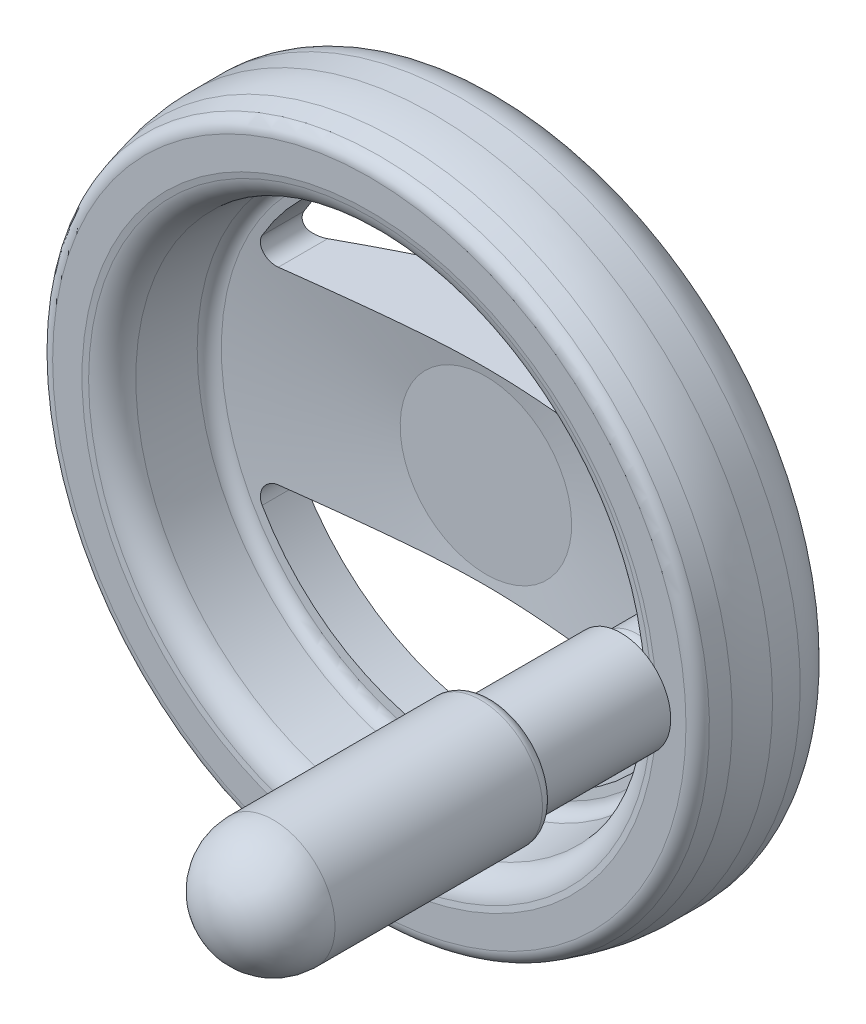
ISO-10303-21;
HEADER;
FILE_DESCRIPTION(('STEP AP214'),'2;1');
FILE_NAME('part.step','',(''),(''),'','','');
FILE_SCHEMA(('AUTOMOTIVE_DESIGN { 1 0 10303 214 1 1 1 1 }'));
ENDSEC;
DATA;
#1=APPLICATION_CONTEXT('core data for automotive mechanical design processes');
#2=APPLICATION_PROTOCOL_DEFINITION('international standard','automotive_design',2000,#1);
#3=PRODUCT_CONTEXT('',#1,'mechanical');
#4=PRODUCT('Part','Part','',(#3));
#5=PRODUCT_RELATED_PRODUCT_CATEGORY('part','',(#4));
#6=PRODUCT_DEFINITION_FORMATION('','',#4);
#7=PRODUCT_DEFINITION_CONTEXT('part definition',#1,'design');
#8=PRODUCT_DEFINITION('design','',#6,#7);
#9=PRODUCT_DEFINITION_SHAPE('','',#8);
#10=(LENGTH_UNIT() NAMED_UNIT(*) SI_UNIT(.MILLI.,.METRE.));
#11=(NAMED_UNIT(*) PLANE_ANGLE_UNIT() SI_UNIT($,.RADIAN.));
#12=(NAMED_UNIT(*) SI_UNIT($,.STERADIAN.) SOLID_ANGLE_UNIT());
#13=UNCERTAINTY_MEASURE_WITH_UNIT(LENGTH_MEASURE(1.E-05),#10,'distance_accuracy_value','');
#14=(GEOMETRIC_REPRESENTATION_CONTEXT(3) GLOBAL_UNCERTAINTY_ASSIGNED_CONTEXT((#13)) GLOBAL_UNIT_ASSIGNED_CONTEXT((#10,
#11,#12)) REPRESENTATION_CONTEXT('',''));
#15=CARTESIAN_POINT('',(0.,0.,0.));
#16=DIRECTION('',(0.,0.,1.));
#17=DIRECTION('',(1.,0.,0.));
#18=AXIS2_PLACEMENT_3D('',#15,#16,#17);
#19=CARTESIAN_POINT('',(0.,0.,16.4212331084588));
#20=DIRECTION('',(0.,0.,1.));
#21=DIRECTION('',(0.,-1.,0.));
#22=AXIS2_PLACEMENT_3D('',#19,#20,#21);
#23=CONICAL_SURFACE('',#22,32.5921943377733,1.02614554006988);
#24=CARTESIAN_POINT('',(-27.6700007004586,-13.75,15.3949916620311));
#25=CARTESIAN_POINT('',(-27.8380509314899,-13.7500359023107,15.4862076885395));
#26=CARTESIAN_POINT('',(-28.0036233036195,-13.7692311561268,15.5813242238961));
#27=CARTESIAN_POINT('',(-28.3192937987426,-13.8419575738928,15.7723976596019));
#28=CARTESIAN_POINT('',(-28.4697133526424,-13.8944000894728,15.8682360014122));
#29=CARTESIAN_POINT('',(-28.7264591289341,-14.0161550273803,16.0403601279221));
#30=CARTESIAN_POINT('',(-28.8355124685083,-14.0798257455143,16.1166371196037));
#31=CARTESIAN_POINT('',(-29.0444499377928,-14.2273192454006,16.2695940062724));
#32=CARTESIAN_POINT('',(-29.1440287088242,-14.3116152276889,16.3462344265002));
#33=CARTESIAN_POINT('',(-29.2361049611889,-14.4049053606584,16.4212331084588));
#34=B_SPLINE_CURVE_WITH_KNOTS('',3,(#24,#25,#26,#27,#28,#29,#30,#31,#32,#33),.UNSPECIFIED.,.F.,
.F.,(4,2,2,2,4),(0.,0.572234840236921,1.12663717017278,1.56768376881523,2.0199959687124),.UNSPECIFIED.);
#35=CARTESIAN_POINT('',(-27.6700007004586,-13.75,15.3949916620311));
#36=VERTEX_POINT('',#35);
#37=CARTESIAN_POINT('',(-29.2361049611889,-14.4049053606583,16.4212331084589));
#38=VERTEX_POINT('',#37);
#39=EDGE_CURVE('E1053',#36,#38,#34,.T.);
#40=ORIENTED_EDGE('',*,*,#39,.T.);
#41=CARTESIAN_POINT('',(0.,0.,16.4212331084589));
#42=DIRECTION('',(0.,0.,-1.));
#43=DIRECTION('',(0.,1.,0.));
#44=AXIS2_PLACEMENT_3D('',#41,#42,#43);
#45=CIRCLE('',#44,32.5921943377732);
#46=CARTESIAN_POINT('',(-29.2361049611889,14.4049053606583,16.4212331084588));
#47=VERTEX_POINT('',#46);
#48=EDGE_CURVE('E393',#38,#47,#45,.T.);
#49=ORIENTED_EDGE('',*,*,#48,.T.);
#50=CARTESIAN_POINT('',(-29.2361049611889,14.4049053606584,16.4212331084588));
#51=CARTESIAN_POINT('',(-29.1197251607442,14.2869572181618,16.3264513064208));
#52=CARTESIAN_POINT('',(-28.9912517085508,14.1833565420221,16.2289487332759));
#53=CARTESIAN_POINT('',(-28.7199118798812,14.0102144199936,16.0352037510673));
#54=CARTESIAN_POINT('',(-28.5776199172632,13.939710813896,15.9390170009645));
#55=CARTESIAN_POINT('',(-28.3105578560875,13.8415310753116,15.767552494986));
#56=CARTESIAN_POINT('',(-28.1880713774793,13.808074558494,15.6919835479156));
#57=CARTESIAN_POINT('',(-27.9343495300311,13.7620491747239,15.5417459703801));
#58=CARTESIAN_POINT('',(-27.8029703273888,13.7500381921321,15.4671501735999));
#59=CARTESIAN_POINT('',(-27.6700007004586,13.75,15.3949916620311));
#60=B_SPLINE_CURVE_WITH_KNOTS('',3,(#50,#51,#52,#53,#54,#55,#56,#57,#58,#59),.UNSPECIFIED.,.F.,
.F.,(4,2,2,2,4),(0.,0.571600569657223,1.12535971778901,1.56702493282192,2.02002089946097),.UNSPECIFIED.);
#61=CARTESIAN_POINT('',(-27.6700007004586,13.75,15.3949916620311));
#62=VERTEX_POINT('',#61);
#63=EDGE_CURVE('E461',#47,#62,#60,.T.);
#64=ORIENTED_EDGE('',*,*,#63,.T.);
#65=CARTESIAN_POINT('',(-27.6700007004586,13.75,15.3949916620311));
#66=CARTESIAN_POINT('',(-27.0561880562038,13.75,15.0620473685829));
#67=CARTESIAN_POINT('',(-26.4414809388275,13.75,14.7307395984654));
#68=CARTESIAN_POINT('',(-25.2098722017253,13.75,14.0721703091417));
#69=CARTESIAN_POINT('',(-24.5929704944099,13.75,13.7449089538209));
#70=CARTESIAN_POINT('',(-23.355795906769,13.75,13.0948014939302));
#71=CARTESIAN_POINT('',(-22.7355196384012,13.75,12.7719618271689));
#72=CARTESIAN_POINT('',(-21.4919225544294,13.75,12.1322121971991));
#73=CARTESIAN_POINT('',(-20.8686017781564,13.75,11.8153021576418));
#74=CARTESIAN_POINT('',(-19.5856769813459,13.75,11.1724188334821));
#75=CARTESIAN_POINT('',(-18.9258770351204,13.75,10.846835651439));
#76=CARTESIAN_POINT('',(-17.6013244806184,13.75,10.2058160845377));
#77=CARTESIAN_POINT('',(-16.9365717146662,13.75,9.89038002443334));
#78=CARTESIAN_POINT('',(-15.6013533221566,13.75,9.27262707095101));
#79=CARTESIAN_POINT('',(-14.9308904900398,13.75,8.97030415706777));
#80=CARTESIAN_POINT('',(-13.5826523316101,13.75,8.38243129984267));
#81=CARTESIAN_POINT('',(-12.9048775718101,13.75,8.09688006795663));
#82=CARTESIAN_POINT('',(-11.8262615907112,13.75,7.66279645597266));
#83=CARTESIAN_POINT('',(-11.428353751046,13.75,7.50697700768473));
#84=CARTESIAN_POINT('',(-10.6292293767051,13.75,7.20408630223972));
#85=CARTESIAN_POINT('',(-10.2280129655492,13.75,7.05701472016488));
#86=CARTESIAN_POINT('',(-9.42185371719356,13.75,6.77310267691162));
#87=CARTESIAN_POINT('',(-9.01691011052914,13.75,6.63626438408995));
#88=CARTESIAN_POINT('',(-8.20317392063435,13.75,6.37465156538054));
#89=CARTESIAN_POINT('',(-7.79438133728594,13.75,6.24987703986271));
#90=CARTESIAN_POINT('',(-6.5780573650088,13.75,5.90130506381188));
#91=CARTESIAN_POINT('',(-5.76451684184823,13.75,5.69745122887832));
#92=CARTESIAN_POINT('',(-4.53345646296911,13.75,5.44514026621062));
#93=CARTESIAN_POINT('',(-4.12134200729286,13.75,5.36995179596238));
#94=CARTESIAN_POINT('',(-3.2939304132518,13.75,5.23946364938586));
#95=CARTESIAN_POINT('',(-2.87863330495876,13.75,5.18416378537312));
#96=CARTESIAN_POINT('',(-2.03732158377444,13.75,5.09433620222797));
#97=CARTESIAN_POINT('',(-1.61125948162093,13.75,5.06024891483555));
#98=CARTESIAN_POINT('',(-0.757887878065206,13.75,5.01587983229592));
#99=CARTESIAN_POINT('',(-0.330578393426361,13.75,5.00559771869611));
#100=CARTESIAN_POINT('',(0.523885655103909,13.75,5.00923692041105));
#101=CARTESIAN_POINT('',(0.951040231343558,13.75,5.0231553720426));
#102=CARTESIAN_POINT('',(1.80391240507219,13.75,5.07465256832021));
#103=CARTESIAN_POINT('',(2.22962997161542,13.75,5.11223181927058));
#104=CARTESIAN_POINT('',(3.08737847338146,13.75,5.21070534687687));
#105=CARTESIAN_POINT('',(3.5193546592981,13.75,5.27207189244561));
#106=CARTESIAN_POINT('',(4.379778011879,13.75,5.41596395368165));
#107=CARTESIAN_POINT('',(4.80822480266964,13.75,5.49849169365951));
#108=CARTESIAN_POINT('',(5.66125298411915,13.75,5.68233915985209));
#109=CARTESIAN_POINT('',(6.08583237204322,13.75,5.78366809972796));
#110=CARTESIAN_POINT('',(6.93073436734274,13.75,6.00263380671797));
#111=CARTESIAN_POINT('',(7.35105695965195,13.75,6.12027063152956));
#112=CARTESIAN_POINT('',(8.22129298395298,13.75,6.37960060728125));
#113=CARTESIAN_POINT('',(8.67085431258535,13.75,6.52246935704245));
#114=CARTESIAN_POINT('',(9.56539455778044,13.75,6.8219476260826));
#115=CARTESIAN_POINT('',(10.0103730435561,13.75,6.97855842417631));
#116=CARTESIAN_POINT('',(10.8962795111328,13.75,7.30334313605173));
#117=CARTESIAN_POINT('',(11.3372057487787,13.75,7.47152178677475));
#118=CARTESIAN_POINT('',(12.2152359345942,13.75,7.81750681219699));
#119=CARTESIAN_POINT('',(12.6523399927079,13.75,7.99531290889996));
#120=CARTESIAN_POINT('',(13.5241106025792,13.75,8.35940533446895));
#121=CARTESIAN_POINT('',(13.9587697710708,13.75,8.54570929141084));
#122=CARTESIAN_POINT('',(14.8250878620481,13.75,8.92515752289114));
#123=CARTESIAN_POINT('',(15.2567467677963,13.75,9.11830183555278));
#124=CARTESIAN_POINT('',(16.1173244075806,13.75,9.51033352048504));
#125=CARTESIAN_POINT('',(16.5462437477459,13.75,9.70921956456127));
#126=CARTESIAN_POINT('',(17.4017640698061,13.75,10.1119219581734));
#127=CARTESIAN_POINT('',(17.8283650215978,13.75,10.3157383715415));
#128=CARTESIAN_POINT('',(19.051703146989,13.75,10.9076452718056));
#129=CARTESIAN_POINT('',(19.8458857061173,13.75,11.3010168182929));
#130=CARTESIAN_POINT('',(21.4286507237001,13.75,12.0989359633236));
#131=CARTESIAN_POINT('',(22.2172328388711,13.75,12.5034842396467));
#132=CARTESIAN_POINT('',(23.7852437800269,13.75,13.3187910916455));
#133=CARTESIAN_POINT('',(24.5646991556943,13.75,13.7294986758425));
#134=CARTESIAN_POINT('',(25.7311414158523,13.75,14.3505716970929));
#135=CARTESIAN_POINT('',(26.1194737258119,13.75,14.5584177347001));
#136=CARTESIAN_POINT('',(26.8953251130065,13.75,14.975616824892));
#137=CARTESIAN_POINT('',(27.2828441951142,13.75,15.1849698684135));
#138=CARTESIAN_POINT('',(27.6700007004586,13.75,15.3949916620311));
#139=B_SPLINE_CURVE_WITH_KNOTS('',3,(#65,#66,#67,#68,#69,#70,#71,#72,#73,#74,#75,#76,#77,#78,
#79,#80,#81,#82,#83,#84,#85,#86,#87,#88,#89,#90,#91,#92,#93,#94,#95,#96,#97,#98,#99,#100,#101,
#102,#103,#104,#105,#106,#107,#108,#109,#110,#111,#112,#113,#114,#115,#116,#117,#118,#119,#120,
#121,#122,#123,#124,#125,#126,#127,#128,#129,#130,#131,#132,#133,#134,#135,#136,#137,#138),
.UNSPECIFIED.,.F.,.F.,(4,2,2,2,2,2,2,2,2,2,2,2,2,2,2,2,2,2,2,2,2,2,2,2,2,2,2,2,2,2,2,2,2,2,2,2,
4),(0.,2.09489561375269,4.18987579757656,6.28763700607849,8.3853711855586,10.5925786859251,
12.7998567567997,15.0061104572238,17.212194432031,18.4940981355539,19.7759541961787,
21.058081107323,22.3402080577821,24.8532993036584,26.1096607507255,27.3660103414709,
28.6476436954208,29.9292599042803,31.2107244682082,32.4922164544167,33.8005741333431,
35.1090693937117,36.4182075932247,37.7273504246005,39.1422347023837,40.5572507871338,
41.9728497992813,43.3884079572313,44.807049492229,46.2256989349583,47.6440228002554,
49.062365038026,51.7210307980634,54.3798581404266,57.0229334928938,58.3443006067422,
59.6656597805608),.UNSPECIFIED.);
#140=CARTESIAN_POINT('',(27.6700007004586,13.75,15.3949916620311));
#141=VERTEX_POINT('',#140);
#142=EDGE_CURVE('E1059',#62,#141,#139,.T.);
#143=ORIENTED_EDGE('',*,*,#142,.T.);
#144=CARTESIAN_POINT('',(27.6700007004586,13.75,15.3949916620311));
#145=CARTESIAN_POINT('',(27.8380509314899,13.7500359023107,15.4862076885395));
#146=CARTESIAN_POINT('',(28.0036233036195,13.7692311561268,15.5813242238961));
#147=CARTESIAN_POINT('',(28.3192937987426,13.8419575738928,15.7723976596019));
#148=CARTESIAN_POINT('',(28.4697133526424,13.8944000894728,15.8682360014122));
#149=CARTESIAN_POINT('',(28.7264591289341,14.0161550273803,16.0403601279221));
#150=CARTESIAN_POINT('',(28.8355124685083,14.0798257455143,16.1166371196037));
#151=CARTESIAN_POINT('',(29.0444499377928,14.2273192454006,16.2695940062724));
#152=CARTESIAN_POINT('',(29.1440287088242,14.3116152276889,16.3462344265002));
#153=CARTESIAN_POINT('',(29.2361049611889,14.4049053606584,16.4212331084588));
#154=B_SPLINE_CURVE_WITH_KNOTS('',3,(#144,#145,#146,#147,#148,#149,#150,#151,#152,#153),
.UNSPECIFIED.,.F.,.F.,(4,2,2,2,4),(0.,0.572234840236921,1.12663717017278,1.56768376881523,
2.0199959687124),.UNSPECIFIED.);
#155=CARTESIAN_POINT('',(29.2361049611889,14.4049053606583,16.4212331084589));
#156=VERTEX_POINT('',#155);
#157=EDGE_CURVE('E1056',#141,#156,#154,.T.);
#158=ORIENTED_EDGE('',*,*,#157,.T.);
#159=CARTESIAN_POINT('',(0.,0.,16.4212331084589));
#160=DIRECTION('',(0.,0.,-1.));
#161=DIRECTION('',(0.,1.,0.));
#162=AXIS2_PLACEMENT_3D('',#159,#160,#161);
#163=CIRCLE('',#162,32.5921943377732);
#164=CARTESIAN_POINT('',(29.2361049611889,-14.4049053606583,16.4212331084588));
#165=VERTEX_POINT('',#164);
#166=EDGE_CURVE('E331',#156,#165,#163,.T.);
#167=ORIENTED_EDGE('',*,*,#166,.T.);
#168=CARTESIAN_POINT('',(29.2361049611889,-14.4049053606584,16.4212331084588));
#169=CARTESIAN_POINT('',(29.1197251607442,-14.2869572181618,16.3264513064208));
#170=CARTESIAN_POINT('',(28.9912517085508,-14.1833565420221,16.2289487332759));
#171=CARTESIAN_POINT('',(28.7199118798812,-14.0102144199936,16.0352037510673));
#172=CARTESIAN_POINT('',(28.5776199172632,-13.939710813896,15.9390170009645));
#173=CARTESIAN_POINT('',(28.3105578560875,-13.8415310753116,15.767552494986));
#174=CARTESIAN_POINT('',(28.1880713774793,-13.808074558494,15.6919835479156));
#175=CARTESIAN_POINT('',(27.9343495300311,-13.7620491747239,15.5417459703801));
#176=CARTESIAN_POINT('',(27.8029703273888,-13.7500381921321,15.4671501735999));
#177=CARTESIAN_POINT('',(27.6700007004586,-13.75,15.3949916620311));
#178=B_SPLINE_CURVE_WITH_KNOTS('',3,(#168,#169,#170,#171,#172,#173,#174,#175,#176,#177),
.UNSPECIFIED.,.F.,.F.,(4,2,2,2,4),(0.,0.571600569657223,1.12535971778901,1.56702493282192,
2.02002089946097),.UNSPECIFIED.);
#179=CARTESIAN_POINT('',(27.6700007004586,-13.75,15.3949916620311));
#180=VERTEX_POINT('',#179);
#181=EDGE_CURVE('E420',#165,#180,#178,.T.);
#182=ORIENTED_EDGE('',*,*,#181,.T.);
#183=CARTESIAN_POINT('',(27.6700007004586,-13.75,15.3949916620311));
#184=CARTESIAN_POINT('',(27.0561880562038,-13.75,15.0620473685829));
#185=CARTESIAN_POINT('',(26.4414809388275,-13.75,14.7307395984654));
#186=CARTESIAN_POINT('',(25.2098722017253,-13.75,14.0721703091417));
#187=CARTESIAN_POINT('',(24.5929704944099,-13.75,13.7449089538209));
#188=CARTESIAN_POINT('',(23.355795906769,-13.75,13.0948014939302));
#189=CARTESIAN_POINT('',(22.7355196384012,-13.75,12.7719618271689));
#190=CARTESIAN_POINT('',(21.4919225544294,-13.75,12.1322121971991));
#191=CARTESIAN_POINT('',(20.8686017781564,-13.75,11.8153021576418));
#192=CARTESIAN_POINT('',(19.5856769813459,-13.75,11.1724188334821));
#193=CARTESIAN_POINT('',(18.9258770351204,-13.75,10.846835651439));
#194=CARTESIAN_POINT('',(17.6013244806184,-13.75,10.2058160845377));
#195=CARTESIAN_POINT('',(16.9365717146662,-13.75,9.89038002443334));
#196=CARTESIAN_POINT('',(15.6013533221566,-13.75,9.27262707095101));
#197=CARTESIAN_POINT('',(14.9308904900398,-13.75,8.97030415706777));
#198=CARTESIAN_POINT('',(13.5826523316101,-13.75,8.38243129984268));
#199=CARTESIAN_POINT('',(12.9048775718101,-13.75,8.09688006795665));
#200=CARTESIAN_POINT('',(11.8262615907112,-13.75,7.66279645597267));
#201=CARTESIAN_POINT('',(11.428353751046,-13.75,7.50697700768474));
#202=CARTESIAN_POINT('',(10.6292293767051,-13.75,7.20408630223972));
#203=CARTESIAN_POINT('',(10.2280129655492,-13.75,7.05701472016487));
#204=CARTESIAN_POINT('',(9.42185371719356,-13.75,6.77310267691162));
#205=CARTESIAN_POINT('',(9.01691011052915,-13.75,6.63626438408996));
#206=CARTESIAN_POINT('',(8.20317392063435,-13.75,6.37465156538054));
#207=CARTESIAN_POINT('',(7.79438133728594,-13.75,6.24987703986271));
#208=CARTESIAN_POINT('',(6.57805736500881,-13.75,5.90130506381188));
#209=CARTESIAN_POINT('',(5.76451684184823,-13.75,5.69745122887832));
#210=CARTESIAN_POINT('',(4.53345646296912,-13.75,5.44514026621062));
#211=CARTESIAN_POINT('',(4.12134200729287,-13.75,5.36995179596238));
#212=CARTESIAN_POINT('',(3.29393041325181,-13.75,5.23946364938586));
#213=CARTESIAN_POINT('',(2.87863330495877,-13.75,5.18416378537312));
#214=CARTESIAN_POINT('',(2.03732158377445,-13.75,5.09433620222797));
#215=CARTESIAN_POINT('',(1.61125948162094,-13.75,5.06024891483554));
#216=CARTESIAN_POINT('',(0.757887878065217,-13.75,5.01587983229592));
#217=CARTESIAN_POINT('',(0.330578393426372,-13.75,5.0055977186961));
#218=CARTESIAN_POINT('',(-0.523885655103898,-13.75,5.00923692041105));
#219=CARTESIAN_POINT('',(-0.951040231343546,-13.75,5.0231553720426));
#220=CARTESIAN_POINT('',(-1.80391240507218,-13.75,5.07465256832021));
#221=CARTESIAN_POINT('',(-2.22962997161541,-13.75,5.11223181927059));
#222=CARTESIAN_POINT('',(-3.08737847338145,-13.75,5.21070534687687));
#223=CARTESIAN_POINT('',(-3.51935465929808,-13.75,5.27207189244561));
#224=CARTESIAN_POINT('',(-4.37977801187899,-13.75,5.41596395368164));
#225=CARTESIAN_POINT('',(-4.80822480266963,-13.75,5.49849169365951));
#226=CARTESIAN_POINT('',(-5.66125298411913,-13.75,5.68233915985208));
#227=CARTESIAN_POINT('',(-6.08583237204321,-13.75,5.78366809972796));
#228=CARTESIAN_POINT('',(-6.93073436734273,-13.75,6.00263380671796));
#229=CARTESIAN_POINT('',(-7.35105695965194,-13.75,6.12027063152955));
#230=CARTESIAN_POINT('',(-8.22129298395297,-13.75,6.37960060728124));
#231=CARTESIAN_POINT('',(-8.67085431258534,-13.75,6.52246935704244));
#232=CARTESIAN_POINT('',(-9.56539455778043,-13.75,6.82194762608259));
#233=CARTESIAN_POINT('',(-10.010373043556,-13.75,6.9785584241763));
#234=CARTESIAN_POINT('',(-10.8962795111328,-13.75,7.30334313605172));
#235=CARTESIAN_POINT('',(-11.3372057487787,-13.75,7.47152178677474));
#236=CARTESIAN_POINT('',(-12.2152359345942,-13.75,7.81750681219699));
#237=CARTESIAN_POINT('',(-12.6523399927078,-13.75,7.99531290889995));
#238=CARTESIAN_POINT('',(-13.5241106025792,-13.75,8.35940533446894));
#239=CARTESIAN_POINT('',(-13.9587697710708,-13.75,8.54570929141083));
#240=CARTESIAN_POINT('',(-14.8250878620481,-13.75,8.92515752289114));
#241=CARTESIAN_POINT('',(-15.2567467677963,-13.75,9.11830183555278));
#242=CARTESIAN_POINT('',(-16.1173244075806,-13.75,9.51033352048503));
#243=CARTESIAN_POINT('',(-16.5462437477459,-13.75,9.70921956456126));
#244=CARTESIAN_POINT('',(-17.401764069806,-13.75,10.1119219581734));
#245=CARTESIAN_POINT('',(-17.8283650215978,-13.75,10.3157383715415));
#246=CARTESIAN_POINT('',(-19.051703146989,-13.75,10.9076452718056));
#247=CARTESIAN_POINT('',(-19.8458857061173,-13.75,11.3010168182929));
#248=CARTESIAN_POINT('',(-21.4286507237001,-13.75,12.0989359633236));
#249=CARTESIAN_POINT('',(-22.2172328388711,-13.75,12.5034842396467));
#250=CARTESIAN_POINT('',(-23.7852437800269,-13.75,13.3187910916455));
#251=CARTESIAN_POINT('',(-24.5646991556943,-13.75,13.7294986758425));
#252=CARTESIAN_POINT('',(-25.7311414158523,-13.75,14.3505716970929));
#253=CARTESIAN_POINT('',(-26.1194737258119,-13.75,14.5584177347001));
#254=CARTESIAN_POINT('',(-26.8953251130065,-13.75,14.975616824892));
#255=CARTESIAN_POINT('',(-27.2828441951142,-13.75,15.1849698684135));
#256=CARTESIAN_POINT('',(-27.6700007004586,-13.75,15.3949916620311));
#257=B_SPLINE_CURVE_WITH_KNOTS('',3,(#183,#184,#185,#186,#187,#188,#189,#190,#191,#192,#193,
#194,#195,#196,#197,#198,#199,#200,#201,#202,#203,#204,#205,#206,#207,#208,#209,#210,#211,#212,
#213,#214,#215,#216,#217,#218,#219,#220,#221,#222,#223,#224,#225,#226,#227,#228,#229,#230,#231,
#232,#233,#234,#235,#236,#237,#238,#239,#240,#241,#242,#243,#244,#245,#246,#247,#248,#249,#250,
#251,#252,#253,#254,#255,#256),.UNSPECIFIED.,.F.,.F.,(4,2,2,2,2,2,2,2,2,2,2,2,2,2,2,2,2,2,2,2,2,
2,2,2,2,2,2,2,2,2,2,2,2,2,2,2,4),(0.,2.09489561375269,4.18987579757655,6.28763700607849,
8.3853711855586,10.5925786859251,12.7998567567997,15.0061104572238,17.212194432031,
18.4940981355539,19.7759541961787,21.058081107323,22.3402080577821,24.8532993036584,
26.1096607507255,27.3660103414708,28.6476436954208,29.9292599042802,31.2107244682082,
32.4922164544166,33.8005741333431,35.1090693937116,36.4182075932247,37.7273504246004,
39.1422347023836,40.5572507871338,41.9728497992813,43.3884079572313,44.807049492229,
46.2256989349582,47.6440228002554,49.062365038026,51.7210307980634,54.3798581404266,
57.0229334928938,58.3443006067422,59.6656597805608),.UNSPECIFIED.);
#258=EDGE_CURVE('E1051',#180,#36,#257,.T.);
#259=ORIENTED_EDGE('',*,*,#258,.T.);
#260=EDGE_LOOP('',(#40,#49,#64,#143,#158,#167,#182,#259));
#261=FACE_BOUND('',#260,.T.);
#262=CARTESIAN_POINT('',(0.,0.,4.40144230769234));
#263=DIRECTION('',(0.,0.,1.));
#264=DIRECTION('',(-1.,0.,0.));
#265=AXIS2_PLACEMENT_3D('',#262,#263,#264);
#266=CIRCLE('',#265,12.75);
#267=CARTESIAN_POINT('',(-12.75,0.,4.40144230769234));
#268=VERTEX_POINT('',#267);
#269=EDGE_CURVE('E957',#268,#268,#266,.T.);
#270=ORIENTED_EDGE('',*,*,#269,.T.);
#271=EDGE_LOOP('',(#270));
#272=FACE_BOUND('',#271,.T.);
#273=ADVANCED_FACE('F14',(#261,#272),#23,.T.);
#274=CARTESIAN_POINT('',(37.,0.,35.));
#275=DIRECTION('',(0.,0.,-1.));
#276=DIRECTION('',(0.,1.,0.));
#277=AXIS2_PLACEMENT_3D('',#274,#275,#276);
#278=TOROIDAL_SURFACE('',#277,4.,2.);
#279=CARTESIAN_POINT('',(37.8997386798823,5.93215562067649,35.));
#280=CARTESIAN_POINT('',(37.9341339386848,5.92693770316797,35.0543718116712));
#281=CARTESIAN_POINT('',(37.9699924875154,5.91895249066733,35.1074658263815));
#282=CARTESIAN_POINT('',(38.044075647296,5.89795717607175,35.210786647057));
#283=CARTESIAN_POINT('',(38.0822954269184,5.88495706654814,35.261018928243));
#284=CARTESIAN_POINT('',(38.1989349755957,5.83951272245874,35.4061060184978));
#285=CARTESIAN_POINT('',(38.2801807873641,5.80047494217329,35.4966593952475));
#286=CARTESIAN_POINT('',(38.4733689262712,5.69351192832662,35.6927575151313));
#287=CARTESIAN_POINT('',(38.5868289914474,5.62034284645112,35.7938559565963));
#288=CARTESIAN_POINT('',(38.815937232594,5.45514163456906,35.9774649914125));
#289=CARTESIAN_POINT('',(38.9315940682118,5.36300686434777,36.0598690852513));
#290=CARTESIAN_POINT('',(39.1336034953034,5.18804973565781,36.1904325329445));
#291=CARTESIAN_POINT('',(39.2203786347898,5.10823070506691,36.2420743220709));
#292=CARTESIAN_POINT('',(39.3917809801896,4.94152479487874,36.3369439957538));
#293=CARTESIAN_POINT('',(39.4764070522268,4.85463428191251,36.3801675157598));
#294=CARTESIAN_POINT('',(39.6428221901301,4.67467466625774,36.459331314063));
#295=CARTESIAN_POINT('',(39.7246047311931,4.58159261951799,36.4952556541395));
#296=CARTESIAN_POINT('',(39.8845543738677,4.39020483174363,36.5606999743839));
#297=CARTESIAN_POINT('',(39.9627205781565,4.29189780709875,36.590218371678));
#298=CARTESIAN_POINT('',(40.1338450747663,4.0657610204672,36.6503693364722));
#299=CARTESIAN_POINT('',(40.22566196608,3.93665774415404,36.6794614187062));
#300=CARTESIAN_POINT('',(40.4022468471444,3.67232203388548,36.730559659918));
#301=CARTESIAN_POINT('',(40.4870116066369,3.53708683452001,36.7525625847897));
#302=CARTESIAN_POINT('',(40.6480344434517,3.26286802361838,36.7905781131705));
#303=CARTESIAN_POINT('',(40.7243754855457,3.12394165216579,36.8066536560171));
#304=CARTESIAN_POINT('',(40.8690411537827,2.84171773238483,36.8342010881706));
#305=CARTESIAN_POINT('',(40.9373742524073,2.69842500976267,36.8456778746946));
#306=CARTESIAN_POINT('',(41.0015047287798,2.55318575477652,36.8553965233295));
#307=B_SPLINE_CURVE_WITH_KNOTS('',3,(#279,#280,#281,#282,#283,#284,#285,#286,#287,#288,#289,
#290,#291,#292,#293,#294,#295,#296,#297,#298,#299,#300,#301,#302,#303,#304,#305,#306),
.UNSPECIFIED.,.F.,.F.,(4,2,2,2,2,2,2,2,2,2,2,2,2,4),(0.,0.193442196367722,0.386500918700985,
0.767995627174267,1.27130963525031,1.77742272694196,2.16306918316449,2.54891505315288,
2.93559459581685,3.322369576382,3.80510191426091,4.28805416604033,4.7657195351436,
5.24287487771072),.UNSPECIFIED.);
#308=CARTESIAN_POINT('',(37.8997386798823,5.93215562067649,35.));
#309=VERTEX_POINT('',#308);
#310=CARTESIAN_POINT('',(41.0015047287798,2.55318575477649,36.8553965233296));
#311=VERTEX_POINT('',#310);
#312=EDGE_CURVE('E180',#309,#311,#307,.T.);
#313=ORIENTED_EDGE('',*,*,#312,.F.);
#314=CARTESIAN_POINT('',(37.,0.,35.));
#315=DIRECTION('',(0.,0.,1.));
#316=DIRECTION('',(0.,-1.,0.));
#317=AXIS2_PLACEMENT_3D('',#314,#315,#316);
#318=CIRCLE('',#317,6.);
#319=CARTESIAN_POINT('',(37.8997386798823,-5.93215562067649,35.));
#320=VERTEX_POINT('',#319);
#321=EDGE_CURVE('E172',#320,#309,#318,.F.);
#322=ORIENTED_EDGE('',*,*,#321,.F.);
#323=CARTESIAN_POINT('',(41.0015047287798,-2.55318575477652,36.8553965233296));
#324=CARTESIAN_POINT('',(40.9337492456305,-2.70662517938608,36.8451231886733));
#325=CARTESIAN_POINT('',(40.8613082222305,-2.85789341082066,36.8328955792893));
#326=CARTESIAN_POINT('',(40.7075042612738,-3.15556928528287,36.8032419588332));
#327=CARTESIAN_POINT('',(40.6261286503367,-3.30196962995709,36.7858085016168));
#328=CARTESIAN_POINT('',(40.4544211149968,-3.59008983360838,36.7443108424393));
#329=CARTESIAN_POINT('',(40.364022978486,-3.73176309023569,36.7201949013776));
#330=CARTESIAN_POINT('',(40.1755569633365,-4.00806716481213,36.6638415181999));
#331=CARTESIAN_POINT('',(40.0774943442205,-4.14270270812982,36.6316096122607));
#332=CARTESIAN_POINT('',(39.8405261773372,-4.44746199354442,36.5447742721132));
#333=CARTESIAN_POINT('',(39.6988981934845,-4.61446442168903,36.4862951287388));
#334=CARTESIAN_POINT('',(39.4796655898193,-4.85088028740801,36.3815634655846));
#335=CARTESIAN_POINT('',(39.4054801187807,-4.92731629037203,36.343831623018));
#336=CARTESIAN_POINT('',(39.2553679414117,-5.07483768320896,36.2619408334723));
#337=CARTESIAN_POINT('',(39.1794416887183,-5.14592444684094,36.217783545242));
#338=CARTESIAN_POINT('',(38.9889044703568,-5.3153553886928,36.0987670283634));
#339=CARTESIAN_POINT('',(38.8736194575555,-5.40992658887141,36.019484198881));
#340=CARTESIAN_POINT('',(38.6444339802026,-5.58095424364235,35.8425043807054));
#341=CARTESIAN_POINT('',(38.5305294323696,-5.65750242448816,35.7449053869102));
#342=CARTESIAN_POINT('',(38.3730363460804,-5.74963479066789,35.5916784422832));
#343=CARTESIAN_POINT('',(38.3268622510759,-5.77488111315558,35.5444014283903));
#344=CARTESIAN_POINT('',(38.236135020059,-5.82064494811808,35.4461827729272));
#345=CARTESIAN_POINT('',(38.1915807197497,-5.84116591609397,35.395243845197));
#346=CARTESIAN_POINT('',(38.1040665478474,-5.87712722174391,35.2890217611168));
#347=CARTESIAN_POINT('',(38.0611362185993,-5.89249543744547,35.2336893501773));
#348=CARTESIAN_POINT('',(37.9781037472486,-5.91711571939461,35.1194380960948));
#349=CARTESIAN_POINT('',(37.9380090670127,-5.9263521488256,35.060510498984));
#350=CARTESIAN_POINT('',(37.8997386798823,-5.93215562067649,35.));
#351=B_SPLINE_CURVE_WITH_KNOTS('',3,(#323,#324,#325,#326,#327,#328,#329,#330,#331,#332,#333,
#334,#335,#336,#337,#338,#339,#340,#341,#342,#343,#344,#345,#346,#347,#348,#349,#350),
.UNSPECIFIED.,.F.,.F.,(4,2,2,2,2,2,2,2,2,2,2,2,2,4),(0.,0.504090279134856,1.00890506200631,
1.51774317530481,2.02623512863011,2.70414199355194,3.04288733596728,3.38154538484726,
3.88663326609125,4.38909213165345,4.60110185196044,4.81295604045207,5.02766249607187,
5.24291439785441),.UNSPECIFIED.);
#352=CARTESIAN_POINT('',(41.0015047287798,-2.5531857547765,36.8553965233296));
#353=VERTEX_POINT('',#352);
#354=EDGE_CURVE('E169',#353,#320,#351,.T.);
#355=ORIENTED_EDGE('',*,*,#354,.F.);
#356=CARTESIAN_POINT('',(41.0015047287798,-2.55318575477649,36.8553965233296));
#357=CARTESIAN_POINT('',(41.067359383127,-2.40407138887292,36.8653504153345));
#358=CARTESIAN_POINT('',(41.1266141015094,-2.25204231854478,36.8742643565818));
#359=CARTESIAN_POINT('',(41.2321695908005,-1.94353140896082,36.8900857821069));
#360=CARTESIAN_POINT('',(41.2784772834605,-1.7870519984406,36.8969943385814));
#361=CARTESIAN_POINT('',(41.358091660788,-1.47228946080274,36.9088349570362));
#362=CARTESIAN_POINT('',(41.3915125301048,-1.31403559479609,36.9137843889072));
#363=CARTESIAN_POINT('',(41.4464183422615,-0.995462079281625,36.9218966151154));
#364=CARTESIAN_POINT('',(41.4679055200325,-0.835142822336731,36.9250597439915));
#365=CARTESIAN_POINT('',(41.4946037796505,-0.562353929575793,36.9289849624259));
#366=CARTESIAN_POINT('',(41.5027779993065,-0.450169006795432,36.9301847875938));
#367=CARTESIAN_POINT('',(41.5136803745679,-0.225326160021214,36.9317844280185));
#368=CARTESIAN_POINT('',(41.516398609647,-0.112667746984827,36.9321827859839));
#369=CARTESIAN_POINT('',(41.5164016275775,0.169359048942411,36.932183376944));
#370=CARTESIAN_POINT('',(41.5102642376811,0.338739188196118,36.9312841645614));
#371=CARTESIAN_POINT('',(41.4855225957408,0.676651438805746,36.9276506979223));
#372=CARTESIAN_POINT('',(41.4669122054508,0.845183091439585,36.9249155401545));
#373=CARTESIAN_POINT('',(41.416767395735,1.18011485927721,36.9175190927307));
#374=CARTESIAN_POINT('',(41.3852458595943,1.34651692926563,36.9128597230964));
#375=CARTESIAN_POINT('',(41.3087482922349,1.67604885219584,36.9015026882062));
#376=CARTESIAN_POINT('',(41.2637816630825,1.83918090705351,36.8948064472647));
#377=CARTESIAN_POINT('',(41.181565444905,2.09400393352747,36.8825044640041));
#378=CARTESIAN_POINT('',(41.1488715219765,2.18721757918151,36.8776015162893));
#379=CARTESIAN_POINT('',(41.0787496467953,2.37170266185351,36.8670568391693));
#380=CARTESIAN_POINT('',(41.0413261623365,2.46297583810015,36.8614158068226));
#381=CARTESIAN_POINT('',(41.0015047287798,2.55318575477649,36.8553965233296));
#382=B_SPLINE_CURVE_WITH_KNOTS('',3,(#356,#357,#358,#359,#360,#361,#362,#363,#364,#365,#366,
#367,#368,#369,#370,#371,#372,#373,#374,#375,#376,#377,#378,#379,#380,#381),.UNSPECIFIED.,.F.,
.F.,(4,2,2,2,2,2,2,2,2,2,2,2,4),(0.,0.489685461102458,0.979108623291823,1.46408969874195,
1.94897991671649,2.28631773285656,2.62426837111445,3.13226644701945,3.64051470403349,
4.14825704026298,4.65564514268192,4.95222981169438,5.24853637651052),.UNSPECIFIED.);
#383=EDGE_CURVE('E159',#353,#311,#382,.T.);
#384=ORIENTED_EDGE('',*,*,#383,.T.);
#385=EDGE_LOOP('',(#313,#322,#355,#384));
#386=FACE_BOUND('',#385,.T.);
#387=CARTESIAN_POINT('',(37.,0.,37.));
#388=DIRECTION('',(0.,0.,-1.));
#389=DIRECTION('',(0.,-1.,0.));
#390=AXIS2_PLACEMENT_3D('',#387,#388,#389);
#391=CIRCLE('',#390,4.);
#392=CARTESIAN_POINT('',(37.,-4.,37.));
#393=VERTEX_POINT('',#392);
#394=CARTESIAN_POINT('',(33.,0.,37.));
#395=VERTEX_POINT('',#394);
#396=EDGE_CURVE('E31',#393,#395,#391,.T.);
#397=ORIENTED_EDGE('',*,*,#396,.T.);
#398=CARTESIAN_POINT('',(37.,0.,37.));
#399=DIRECTION('',(0.,0.,-1.));
#400=DIRECTION('',(-1.,0.,0.));
#401=AXIS2_PLACEMENT_3D('',#398,#399,#400);
#402=CIRCLE('',#401,4.);
#403=CARTESIAN_POINT('',(37.,4.,37.));
#404=VERTEX_POINT('',#403);
#405=EDGE_CURVE('E708',#395,#404,#402,.T.);
#406=ORIENTED_EDGE('',*,*,#405,.T.);
#407=CARTESIAN_POINT('',(37.,0.,37.));
#408=DIRECTION('',(0.,0.,-1.));
#409=DIRECTION('',(0.,1.,0.));
#410=AXIS2_PLACEMENT_3D('',#407,#408,#409);
#411=CIRCLE('',#410,4.);
#412=EDGE_CURVE('E809',#404,#393,#411,.T.);
#413=ORIENTED_EDGE('',*,*,#412,.T.);
#414=EDGE_LOOP('',(#397,#406,#413));
#415=FACE_BOUND('',#414,.T.);
#416=ADVANCED_FACE('F170',(#386,#415),#278,.T.);
#417=CARTESIAN_POINT('',(0.,0.,32.9161655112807));
#418=DIRECTION('',(0.,0.,-1.));
#419=DIRECTION('',(0.,1.,0.));
#420=AXIS2_PLACEMENT_3D('',#417,#418,#419);
#421=TOROIDAL_SURFACE('',#420,41.7755146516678,4.);
#422=CARTESIAN_POINT('',(37.312698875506,-5.9918460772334,33.2647884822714));
#423=CARTESIAN_POINT('',(37.3224076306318,-5.99131805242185,33.3735633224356));
#424=CARTESIAN_POINT('',(37.3366894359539,-5.99056976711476,33.4819319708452));
#425=CARTESIAN_POINT('',(37.374275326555,-5.98835043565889,33.6971457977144));
#426=CARTESIAN_POINT('',(37.3975842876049,-5.98687899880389,33.8039901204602));
#427=CARTESIAN_POINT('',(37.4525370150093,-5.98297040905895,34.0132198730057));
#428=CARTESIAN_POINT('',(37.4840054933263,-5.98055307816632,34.1156517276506));
#429=CARTESIAN_POINT('',(37.5552538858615,-5.97435971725,34.3174826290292));
#430=CARTESIAN_POINT('',(37.5950291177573,-5.97058445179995,34.4168833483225));
#431=CARTESIAN_POINT('',(37.6763549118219,-5.9618763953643,34.598034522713));
#432=CARTESIAN_POINT('',(37.7168391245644,-5.95718618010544,34.680277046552));
#433=CARTESIAN_POINT('',(37.8038438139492,-5.94607065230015,34.8423071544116));
#434=CARTESIAN_POINT('',(37.8504136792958,-5.93963061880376,34.9220672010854));
#435=CARTESIAN_POINT('',(37.8997386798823,-5.93215562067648,35.));
#436=B_SPLINE_CURVE_WITH_KNOTS('',3,(#422,#423,#424,#425,#426,#427,#428,#429,#430,#431,#432,
#433,#434,#435),.UNSPECIFIED.,.F.,.F.,(4,2,2,2,2,2,4),(0.,0.327535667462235,0.655248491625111,
0.976432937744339,1.29743682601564,1.57255880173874,1.85007111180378),.UNSPECIFIED.);
#437=CARTESIAN_POINT('',(37.3126988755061,-5.9918460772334,33.2647884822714));
#438=VERTEX_POINT('',#437);
#439=EDGE_CURVE('E193',#438,#320,#436,.T.);
#440=ORIENTED_EDGE('',*,*,#439,.F.);
#441=CARTESIAN_POINT('',(0.,0.,33.2647884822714));
#442=DIRECTION('',(0.,0.,1.));
#443=DIRECTION('',(-1.,0.,0.));
#444=AXIS2_PLACEMENT_3D('',#441,#442,#443);
#445=CIRCLE('',#444,37.7907358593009);
#446=CARTESIAN_POINT('',(37.3126988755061,5.9918460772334,33.2647884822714));
#447=VERTEX_POINT('',#446);
#448=EDGE_CURVE('E176',#438,#447,#445,.F.);
#449=ORIENTED_EDGE('',*,*,#448,.T.);
#450=CARTESIAN_POINT('',(37.8997386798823,5.93215562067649,35.));
#451=CARTESIAN_POINT('',(37.8415098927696,5.94097406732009,34.9080157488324));
#452=CARTESIAN_POINT('',(37.7871281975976,5.94835772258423,34.8134748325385));
#453=CARTESIAN_POINT('',(37.6864430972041,5.96082309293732,34.6200160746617));
#454=CARTESIAN_POINT('',(37.6401411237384,5.96590440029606,34.5210974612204));
#455=CARTESIAN_POINT('',(37.5568449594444,5.97424741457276,34.3216272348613));
#456=CARTESIAN_POINT('',(37.5196861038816,5.97754283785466,34.2211456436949));
#457=CARTESIAN_POINT('',(37.4537844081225,5.9829067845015,34.0174749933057));
#458=CARTESIAN_POINT('',(37.4250377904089,5.98497585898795,33.9142871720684));
#459=CARTESIAN_POINT('',(37.3796196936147,5.98801609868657,33.7207834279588));
#460=CARTESIAN_POINT('',(37.3618099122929,5.98910187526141,33.630734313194));
#461=CARTESIAN_POINT('',(37.3324377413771,5.99079877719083,33.4488249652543));
#462=CARTESIAN_POINT('',(37.320930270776,5.99140574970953,33.3569558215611));
#463=CARTESIAN_POINT('',(37.312698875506,5.9918460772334,33.2647884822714));
#464=B_SPLINE_CURVE_WITH_KNOTS('',3,(#450,#451,#452,#453,#454,#455,#456,#457,#458,#459,#460,
#461,#462,#463),.UNSPECIFIED.,.F.,.F.,(4,2,2,2,2,2,4),(0.,0.327542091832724,0.655142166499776,
0.976320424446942,1.2973542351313,1.57253038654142,1.85006777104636),.UNSPECIFIED.);
#465=EDGE_CURVE('E609',#309,#447,#464,.T.);
#466=ORIENTED_EDGE('',*,*,#465,.F.);
#467=ORIENTED_EDGE('',*,*,#312,.T.);
#468=CARTESIAN_POINT('',(0.,0.,36.8553965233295));
#469=DIRECTION('',(0.,0.,-1.));
#470=DIRECTION('',(0.,1.,0.));
#471=AXIS2_PLACEMENT_3D('',#468,#469,#470);
#472=CIRCLE('',#471,41.0809219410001);
#473=EDGE_CURVE('E157',#311,#353,#472,.F.);
#474=ORIENTED_EDGE('',*,*,#473,.T.);
#475=ORIENTED_EDGE('',*,*,#354,.T.);
#476=EDGE_LOOP('',(#440,#449,#466,#467,#474,#475));
#477=FACE_BOUND('',#476,.T.);
#478=ADVANCED_FACE('F178',(#477),#421,.T.);
#479=CARTESIAN_POINT('',(37.,0.,27.6666666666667));
#480=DIRECTION('',(0.,0.,1.));
#481=DIRECTION('',(0.,-1.,0.));
#482=AXIS2_PLACEMENT_3D('',#479,#480,#481);
#483=CYLINDRICAL_SURFACE('',#482,6.);
#484=ORIENTED_EDGE('',*,*,#439,.T.);
#485=ORIENTED_EDGE('',*,*,#321,.T.);
#486=ORIENTED_EDGE('',*,*,#465,.T.);
#487=CARTESIAN_POINT('',(37.3126988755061,5.9918460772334,33.2647884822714));
#488=CARTESIAN_POINT('',(37.2513795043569,5.9950452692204,32.5785702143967));
#489=CARTESIAN_POINT('',(37.1902047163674,5.99729487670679,31.8923346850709));
#490=CARTESIAN_POINT('',(37.0681452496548,5.99992377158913,30.5198393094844));
#491=CARTESIAN_POINT('',(37.0072605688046,6.00030307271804,29.8335794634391));
#492=CARTESIAN_POINT('',(36.8857813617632,5.99922024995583,28.4610356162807));
#493=CARTESIAN_POINT('',(36.8251868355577,5.9977581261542,27.7747516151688));
#494=CARTESIAN_POINT('',(36.7042879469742,5.99301357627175,26.4021592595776));
#495=CARTESIAN_POINT('',(36.64398358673,5.98973113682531,25.7158509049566));
#496=CARTESIAN_POINT('',(36.5838247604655,5.9855491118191,25.0295353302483));
#497=B_SPLINE_CURVE_WITH_KNOTS('',3,(#487,#488,#489,#490,#491,#492,#493,#494,#495,#496),
.UNSPECIFIED.,.F.,.F.,(4,2,2,2,4),(0.,2.06687905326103,4.13374293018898,6.20060670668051,
8.26748565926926),.UNSPECIFIED.);
#498=CARTESIAN_POINT('',(36.5838247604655,5.9855491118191,25.0295353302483));
#499=VERTEX_POINT('',#498);
#500=EDGE_CURVE('E598',#447,#499,#497,.T.);
#501=ORIENTED_EDGE('',*,*,#500,.T.);
#502=CARTESIAN_POINT('',(36.5838247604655,5.9855491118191,25.0295353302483));
#503=CARTESIAN_POINT('',(36.5789216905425,5.98520259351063,24.9735264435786));
#504=CARTESIAN_POINT('',(36.5716412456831,5.9846958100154,24.9177301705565));
#505=CARTESIAN_POINT('',(36.5524159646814,5.98329166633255,24.8069563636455));
#506=CARTESIAN_POINT('',(36.5404714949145,5.98239433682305,24.7519787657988));
#507=CARTESIAN_POINT('',(36.5120108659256,5.98013927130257,24.6432389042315));
#508=CARTESIAN_POINT('',(36.4954957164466,5.97878163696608,24.5894763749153));
#509=CARTESIAN_POINT('',(36.4580421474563,5.97550282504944,24.4835490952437));
#510=CARTESIAN_POINT('',(36.4371037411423,5.97358164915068,24.4313843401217));
#511=CARTESIAN_POINT('',(36.3678709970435,5.96678969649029,24.2778048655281));
#512=CARTESIAN_POINT('',(36.3131424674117,5.96088947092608,24.1792416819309));
#513=CARTESIAN_POINT('',(36.1883822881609,5.94518343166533,23.9928042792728));
#514=CARTESIAN_POINT('',(36.1183573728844,5.9353793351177,23.9049253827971));
#515=CARTESIAN_POINT('',(35.965338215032,5.91062325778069,23.7423803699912));
#516=CARTESIAN_POINT('',(35.8823639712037,5.89567917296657,23.6676942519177));
#517=CARTESIAN_POINT('',(35.7060073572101,5.8594919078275,23.5335454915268));
#518=CARTESIAN_POINT('',(35.6126235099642,5.83824783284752,23.474085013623));
#519=CARTESIAN_POINT('',(35.4674808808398,5.80119721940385,23.3977653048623));
#520=CARTESIAN_POINT('',(35.4183235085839,5.78800367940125,23.3744927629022));
#521=CARTESIAN_POINT('',(35.3186506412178,5.75983864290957,23.3322949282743));
#522=CARTESIAN_POINT('',(35.2681350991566,5.74486708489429,23.3133697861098));
#523=CARTESIAN_POINT('',(35.1661147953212,5.71311817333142,23.2799616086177));
#524=CARTESIAN_POINT('',(35.1146085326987,5.69633786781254,23.2654859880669));
#525=CARTESIAN_POINT('',(35.0111185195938,5.66103899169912,23.2410600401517));
#526=CARTESIAN_POINT('',(34.959134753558,5.64252036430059,23.2311098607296));
#527=CARTESIAN_POINT('',(34.9071290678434,5.62315669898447,23.2234432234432));
#528=B_SPLINE_CURVE_WITH_KNOTS('',3,(#502,#503,#504,#505,#506,#507,#508,#509,#510,#511,#512,
#513,#514,#515,#516,#517,#518,#519,#520,#521,#522,#523,#524,#525,#526,#527),.UNSPECIFIED.,.F.,
.F.,(4,2,2,2,2,2,2,2,2,2,2,2,4),(0.,0.168616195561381,0.337219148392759,0.505784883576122,
0.67435011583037,1.01128678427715,1.3480754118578,1.68434896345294,2.02067029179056,
2.1883902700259,2.35611605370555,2.52411984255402,2.69212912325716),.UNSPECIFIED.);
#529=CARTESIAN_POINT('',(34.9071290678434,5.62315669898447,23.2234432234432));
#530=VERTEX_POINT('',#529);
#531=EDGE_CURVE('E589',#499,#530,#528,.T.);
#532=ORIENTED_EDGE('',*,*,#531,.T.);
#533=CARTESIAN_POINT('',(34.9071290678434,5.62315669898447,23.2234432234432));
#534=CARTESIAN_POINT('',(34.7484744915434,5.56412558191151,23.2000309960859));
#535=CARTESIAN_POINT('',(34.5923052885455,5.49833972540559,23.1768172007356));
#536=CARTESIAN_POINT('',(34.2860131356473,5.35377425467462,23.1309747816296));
#537=CARTESIAN_POINT('',(34.1358901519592,5.274994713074,23.1083461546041));
#538=CARTESIAN_POINT('',(33.842828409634,5.10499419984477,23.0638718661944));
#539=CARTESIAN_POINT('',(33.6998865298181,5.01377869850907,23.0420258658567));
#540=CARTESIAN_POINT('',(33.4221408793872,4.81950625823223,22.9992989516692));
#541=CARTESIAN_POINT('',(33.2873369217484,4.71644959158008,22.9784180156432));
#542=CARTESIAN_POINT('',(33.0267814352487,4.4991471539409,22.9378045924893));
#543=CARTESIAN_POINT('',(32.9010339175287,4.38489647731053,22.9180726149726));
#544=CARTESIAN_POINT('',(32.6595352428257,4.14598900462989,22.8799523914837));
#545=CARTESIAN_POINT('',(32.5437875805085,4.02132860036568,22.8615646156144));
#546=CARTESIAN_POINT('',(32.3232135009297,3.76252203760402,22.826331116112));
#547=CARTESIAN_POINT('',(32.2183854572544,3.62837729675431,22.8094851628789));
#548=CARTESIAN_POINT('',(32.0204209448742,3.35152954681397,22.7775130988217));
#549=CARTESIAN_POINT('',(31.9272843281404,3.20882664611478,22.7623869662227));
#550=CARTESIAN_POINT('',(31.7540165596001,2.91689372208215,22.7341225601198));
#551=CARTESIAN_POINT('',(31.6737996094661,2.76771588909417,22.7209712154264));
#552=CARTESIAN_POINT('',(31.5262348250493,2.46303394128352,22.6966876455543));
#553=CARTESIAN_POINT('',(31.4588823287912,2.30753214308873,22.6855546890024));
#554=CARTESIAN_POINT('',(31.3375878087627,1.99141175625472,22.6654443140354));
#555=CARTESIAN_POINT('',(31.2836334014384,1.83079804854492,22.6564649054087));
#556=CARTESIAN_POINT('',(31.1894908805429,1.5055376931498,22.6407611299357));
#557=CARTESIAN_POINT('',(31.1492985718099,1.34089229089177,22.6340360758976));
#558=CARTESIAN_POINT('',(31.0775647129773,0.981608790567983,22.622015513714));
#559=CARTESIAN_POINT('',(31.0485017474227,0.786457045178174,22.6171318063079));
#560=CARTESIAN_POINT('',(31.0097204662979,0.39419671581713,22.6106114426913));
#561=CARTESIAN_POINT('',(31.0000010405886,0.19708824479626,22.6089746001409));
#562=CARTESIAN_POINT('',(30.999999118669,-0.166924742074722,22.6089741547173));
#563=CARTESIAN_POINT('',(31.006969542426,-0.333834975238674,22.6101479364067));
#564=CARTESIAN_POINT('',(31.034799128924,-0.666516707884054,22.614828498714));
#565=CARTESIAN_POINT('',(31.0556623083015,-0.83228786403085,22.6183359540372));
#566=CARTESIAN_POINT('',(31.1111490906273,-1.16161473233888,22.6276456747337));
#567=CARTESIAN_POINT('',(31.1457865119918,-1.32516804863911,22.6334502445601));
#568=CARTESIAN_POINT('',(31.2285701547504,-1.64878842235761,22.6472851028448));
#569=CARTESIAN_POINT('',(31.2767214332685,-1.80885415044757,22.6553162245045));
#570=CARTESIAN_POINT('',(31.386087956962,-2.12409755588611,22.6734943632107));
#571=CARTESIAN_POINT('',(31.447285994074,-2.27928136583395,22.6836385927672));
#572=CARTESIAN_POINT('',(31.5823529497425,-2.58396634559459,22.7059355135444));
#573=CARTESIAN_POINT('',(31.6562275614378,-2.73346492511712,22.7180891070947));
#574=CARTESIAN_POINT('',(31.816062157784,-3.02564231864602,22.7442610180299));
#575=CARTESIAN_POINT('',(31.9020195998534,-3.16832255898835,22.7582789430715));
#576=CARTESIAN_POINT('',(32.0853603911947,-3.4458622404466,22.7880220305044));
#577=CARTESIAN_POINT('',(32.1827387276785,-3.58072507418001,22.8037464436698));
#578=CARTESIAN_POINT('',(32.3890254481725,-3.84277617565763,22.836868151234));
#579=CARTESIAN_POINT('',(32.4980153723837,-3.96989877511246,22.8542771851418));
#580=CARTESIAN_POINT('',(32.7260807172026,-4.21444668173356,22.8904838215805));
#581=CARTESIAN_POINT('',(32.8451525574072,-4.33187540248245,22.9092809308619));
#582=CARTESIAN_POINT('',(33.0925576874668,-4.55628998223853,22.9480864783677));
#583=CARTESIAN_POINT('',(33.2208898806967,-4.66327707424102,22.9680947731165));
#584=CARTESIAN_POINT('',(33.4858678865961,-4.86607850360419,23.0091325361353));
#585=CARTESIAN_POINT('',(33.6225116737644,-4.96189554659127,23.0301617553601));
#586=CARTESIAN_POINT('',(33.9429812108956,-5.16723675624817,23.0791436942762));
#587=CARTESIAN_POINT('',(34.1292213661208,-5.2729736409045,23.1073724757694));
#588=CARTESIAN_POINT('',(34.4158898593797,-5.41606706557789,23.1504331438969));
#589=CARTESIAN_POINT('',(34.5125974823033,-5.46115477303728,23.1648964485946));
#590=CARTESIAN_POINT('',(34.7082454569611,-5.54610000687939,23.1940268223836));
#591=CARTESIAN_POINT('',(34.8071856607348,-5.58595787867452,23.2086938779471));
#592=CARTESIAN_POINT('',(34.9071290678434,-5.62315669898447,23.2234432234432));
#593=B_SPLINE_CURVE_WITH_KNOTS('',3,(#533,#534,#535,#536,#537,#538,#539,#540,#541,#542,#543,
#544,#545,#546,#547,#548,#549,#550,#551,#552,#553,#554,#555,#556,#557,#558,#559,#560,#561,#562,
#563,#564,#565,#566,#567,#568,#569,#570,#571,#572,#573,#574,#575,#576,#577,#578,#579,#580,#581,
#582,#583,#584,#585,#586,#587,#588,#589,#590,#591,#592),.UNSPECIFIED.,.F.,.F.,(4,2,2,2,2,2,2,2,
2,2,2,2,2,2,2,2,2,2,2,2,2,2,2,2,2,2,2,2,2,4),(0.,0.512524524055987,1.02504618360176,
1.53734311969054,2.04962827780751,2.56213895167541,3.07482801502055,3.58744060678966,
4.1000467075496,4.60909417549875,5.11795681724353,5.6263473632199,6.13458279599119,
6.72567558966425,7.31673445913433,7.81733432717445,8.31807899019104,8.81932727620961,
9.32076338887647,9.82154217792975,10.3225464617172,10.8234454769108,11.3241254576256,
11.8285875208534,12.3328711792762,12.8370952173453,13.3411968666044,13.9878660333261,
14.3107723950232,14.6336574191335),.UNSPECIFIED.);
#594=CARTESIAN_POINT('',(34.9071290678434,-5.62315669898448,23.2234432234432));
#595=VERTEX_POINT('',#594);
#596=EDGE_CURVE('E515',#530,#595,#593,.T.);
#597=ORIENTED_EDGE('',*,*,#596,.T.);
#598=CARTESIAN_POINT('',(34.9071290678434,-5.62315669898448,23.2234432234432));
#599=CARTESIAN_POINT('',(34.957571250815,-5.64193755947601,23.2308800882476));
#600=CARTESIAN_POINT('',(35.0079926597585,-5.65992422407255,23.2404642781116));
#601=CARTESIAN_POINT('',(35.1083990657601,-5.69426384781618,23.2638913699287));
#602=CARTESIAN_POINT('',(35.1583840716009,-5.71061683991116,23.277734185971));
#603=CARTESIAN_POINT('',(35.2574545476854,-5.74162255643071,23.3096202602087));
#604=CARTESIAN_POINT('',(35.3065411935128,-5.75627766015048,23.3276575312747));
#605=CARTESIAN_POINT('',(35.4034729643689,-5.78391268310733,23.367835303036));
#606=CARTESIAN_POINT('',(35.4513181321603,-5.79689266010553,23.3899756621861));
#607=CARTESIAN_POINT('',(35.5924679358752,-5.83337491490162,23.4624049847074));
#608=CARTESIAN_POINT('',(35.6834122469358,-5.85442731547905,23.5187103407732));
#609=CARTESIAN_POINT('',(35.855816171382,-5.89055472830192,23.6457349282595));
#610=CARTESIAN_POINT('',(35.9372776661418,-5.90563092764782,23.7164512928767));
#611=CARTESIAN_POINT('',(36.0888264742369,-5.93091145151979,23.8709155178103));
#612=CARTESIAN_POINT('',(36.1588290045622,-5.94108045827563,23.9547522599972));
#613=CARTESIAN_POINT('',(36.2846757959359,-5.95754646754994,24.1329168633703));
#614=CARTESIAN_POINT('',(36.34051088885,-5.96384096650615,24.2272514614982));
#615=CARTESIAN_POINT('',(36.415151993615,-5.97148823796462,24.3804299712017));
#616=CARTESIAN_POINT('',(36.439440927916,-5.97379674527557,24.4366258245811));
#617=CARTESIAN_POINT('',(36.4828238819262,-5.97770888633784,24.551036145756));
#618=CARTESIAN_POINT('',(36.5019172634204,-5.97931243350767,24.6092508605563));
#619=CARTESIAN_POINT('',(36.5347241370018,-5.98195590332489,24.7272618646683));
#620=CARTESIAN_POINT('',(36.5484310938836,-5.98299514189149,24.7870599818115));
#621=CARTESIAN_POINT('',(36.5703098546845,-5.98460204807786,24.907666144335));
#622=CARTESIAN_POINT('',(36.5784816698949,-5.98516971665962,24.9684741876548));
#623=CARTESIAN_POINT('',(36.5838247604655,-5.98554911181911,25.0295353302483));
#624=B_SPLINE_CURVE_WITH_KNOTS('',3,(#598,#599,#600,#601,#602,#603,#604,#605,#606,#607,#608,
#609,#610,#611,#612,#613,#614,#615,#616,#617,#618,#619,#620,#621,#622,#623),.UNSPECIFIED.,.F.,
.F.,(4,2,2,2,2,2,2,2,2,2,2,2,4),(0.,0.162960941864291,0.325918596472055,0.488645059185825,
0.651365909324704,0.976725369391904,1.30202016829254,1.62962247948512,1.95743625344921,
2.14100657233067,2.32459943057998,2.50841435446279,2.69222890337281),.UNSPECIFIED.);
#625=CARTESIAN_POINT('',(36.5838247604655,-5.9855491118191,25.0295353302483));
#626=VERTEX_POINT('',#625);
#627=EDGE_CURVE('E192',#595,#626,#624,.T.);
#628=ORIENTED_EDGE('',*,*,#627,.T.);
#629=CARTESIAN_POINT('',(36.5838247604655,-5.9855491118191,25.0295353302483));
#630=CARTESIAN_POINT('',(36.64398358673,-5.98973113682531,25.7158509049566));
#631=CARTESIAN_POINT('',(36.7042879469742,-5.99301357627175,26.4021592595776));
#632=CARTESIAN_POINT('',(36.8251868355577,-5.9977581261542,27.7747516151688));
#633=CARTESIAN_POINT('',(36.8857813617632,-5.99922024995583,28.4610356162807));
#634=CARTESIAN_POINT('',(37.0072605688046,-6.00030307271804,29.8335794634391));
#635=CARTESIAN_POINT('',(37.0681452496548,-5.99992377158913,30.5198393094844));
#636=CARTESIAN_POINT('',(37.1902047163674,-5.99729487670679,31.8923346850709));
#637=CARTESIAN_POINT('',(37.2513795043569,-5.9950452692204,32.5785702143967));
#638=CARTESIAN_POINT('',(37.3126988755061,-5.9918460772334,33.2647884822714));
#639=B_SPLINE_CURVE_WITH_KNOTS('',3,(#629,#630,#631,#632,#633,#634,#635,#636,#637,#638),
.UNSPECIFIED.,.F.,.F.,(4,2,2,2,4),(0.,2.06687895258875,4.13374272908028,6.20060660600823,
8.26748565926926),.UNSPECIFIED.);
#640=EDGE_CURVE('E597',#626,#438,#639,.T.);
#641=ORIENTED_EDGE('',*,*,#640,.T.);
#642=EDGE_LOOP('',(#484,#485,#486,#501,#532,#597,#628,#641));
#643=FACE_BOUND('',#642,.T.);
#644=ADVANCED_FACE('F221',(#643),#483,.T.);
#645=CARTESIAN_POINT('',(-44.0400135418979,0.,37.));
#646=DIRECTION('',(0.,0.,1.));
#647=DIRECTION('',(-1.,0.,0.));
#648=AXIS2_PLACEMENT_3D('',#645,#646,#647);
#649=PLANE('',#648);
#650=CARTESIAN_POINT('',(0.,0.,37.));
#651=DIRECTION('',(0.,0.,1.));
#652=DIRECTION('',(0.,-1.,0.));
#653=AXIS2_PLACEMENT_3D('',#650,#651,#652);
#654=CIRCLE('',#653,41.9010090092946);
#655=CARTESIAN_POINT('',(41.826056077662,-2.50511256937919,37.));
#656=VERTEX_POINT('',#655);
#657=CARTESIAN_POINT('',(41.826056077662,2.50511256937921,37.));
#658=VERTEX_POINT('',#657);
#659=EDGE_CURVE('E165',#656,#658,#654,.F.);
#660=ORIENTED_EDGE('',*,*,#659,.T.);
#661=CARTESIAN_POINT('',(37.,0.,37.));
#662=DIRECTION('',(0.,0.,1.));
#663=DIRECTION('',(0.,-1.,0.));
#664=AXIS2_PLACEMENT_3D('',#661,#662,#663);
#665=CIRCLE('',#664,5.4375);
#666=EDGE_CURVE('E770',#656,#658,#665,.T.);
#667=ORIENTED_EDGE('',*,*,#666,.F.);
#668=EDGE_LOOP('',(#660,#667));
#669=FACE_BOUND('',#668,.T.);
#670=CARTESIAN_POINT('',(0.,0.,37.));
#671=DIRECTION('',(0.,0.,-1.));
#672=DIRECTION('',(0.,-1.,0.));
#673=AXIS2_PLACEMENT_3D('',#670,#671,#672);
#674=CIRCLE('',#673,46.1790180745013);
#675=CARTESIAN_POINT('',(0.,-46.1790180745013,37.));
#676=VERTEX_POINT('',#675);
#677=CARTESIAN_POINT('',(-46.1790180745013,0.,37.));
#678=VERTEX_POINT('',#677);
#679=EDGE_CURVE('E989',#676,#678,#674,.T.);
#680=ORIENTED_EDGE('',*,*,#679,.F.);
#681=CARTESIAN_POINT('',(0.,0.,37.));
#682=DIRECTION('',(0.,0.,-1.));
#683=DIRECTION('',(0.,1.,0.));
#684=AXIS2_PLACEMENT_3D('',#681,#682,#683);
#685=CIRCLE('',#684,46.1790180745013);
#686=CARTESIAN_POINT('',(0.,46.1790180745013,37.));
#687=VERTEX_POINT('',#686);
#688=EDGE_CURVE('E197',#687,#676,#685,.T.);
#689=ORIENTED_EDGE('',*,*,#688,.F.);
#690=CARTESIAN_POINT('',(0.,0.,37.));
#691=DIRECTION('',(0.,0.,-1.));
#692=DIRECTION('',(-1.,0.,0.));
#693=AXIS2_PLACEMENT_3D('',#690,#691,#692);
#694=CIRCLE('',#693,46.1790180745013);
#695=EDGE_CURVE('E204',#678,#687,#694,.T.);
#696=ORIENTED_EDGE('',*,*,#695,.F.);
#697=EDGE_LOOP('',(#680,#689,#696));
#698=FACE_BOUND('',#697,.T.);
#699=ADVANCED_FACE('F211',(#669,#698),#649,.T.);
#700=CARTESIAN_POINT('',(0.,0.,37.));
#701=DIRECTION('',(0.,0.,1.));
#702=DIRECTION('',(0.,-1.,0.));
#703=AXIS2_PLACEMENT_3D('',#700,#701,#702);
#704=CONICAL_SURFACE('',#703,41.9010090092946,1.39626340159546);
#705=CARTESIAN_POINT('',(0.,0.,37.));
#706=DIRECTION('',(0.,0.,-1.));
#707=DIRECTION('',(0.,1.,0.));
#708=AXIS2_PLACEMENT_3D('',#705,#706,#707);
#709=CIRCLE('',#708,41.9010090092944);
#710=EDGE_CURVE('E812',#658,#656,#709,.T.);
#711=ORIENTED_EDGE('',*,*,#710,.F.);
#712=ORIENTED_EDGE('',*,*,#659,.F.);
#713=EDGE_LOOP('',(#711,#712));
#714=FACE_BOUND('',#713,.T.);
#715=ORIENTED_EDGE('',*,*,#383,.F.);
#716=ORIENTED_EDGE('',*,*,#473,.F.);
#717=EDGE_LOOP('',(#715,#716));
#718=FACE_BOUND('',#717,.T.);
#719=ADVANCED_FACE('F161',(#714,#718),#704,.F.);
#720=CARTESIAN_POINT('',(0.,0.,35.));
#721=DIRECTION('',(0.,0.,-1.));
#722=DIRECTION('',(0.,1.,0.));
#723=AXIS2_PLACEMENT_3D('',#720,#721,#722);
#724=TOROIDAL_SURFACE('',#723,46.1790180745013,2.);
#725=CARTESIAN_POINT('',(0.,0.,35.517638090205));
#726=DIRECTION('',(0.,0.,-1.));
#727=DIRECTION('',(-1.,0.,0.));
#728=AXIS2_PLACEMENT_3D('',#725,#726,#727);
#729=CIRCLE('',#728,48.1108697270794);
#730=CARTESIAN_POINT('',(-48.1108697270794,0.,35.517638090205));
#731=VERTEX_POINT('',#730);
#732=EDGE_CURVE('E279',#731,#731,#729,.T.);
#733=ORIENTED_EDGE('',*,*,#732,.F.);
#734=EDGE_LOOP('',(#733));
#735=FACE_BOUND('',#734,.T.);
#736=ORIENTED_EDGE('',*,*,#679,.T.);
#737=ORIENTED_EDGE('',*,*,#695,.T.);
#738=ORIENTED_EDGE('',*,*,#688,.T.);
#739=EDGE_LOOP('',(#736,#737,#738));
#740=FACE_BOUND('',#739,.T.);
#741=ADVANCED_FACE('F254',(#735,#740),#724,.T.);
#742=CARTESIAN_POINT('',(0.,0.,32.8766642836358));
#743=DIRECTION('',(0.,0.,-1.));
#744=DIRECTION('',(0.,1.,0.));
#745=AXIS2_PLACEMENT_3D('',#742,#743,#744);
#746=CONICAL_SURFACE('',#745,48.8185165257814,0.261799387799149);
#747=CARTESIAN_POINT('',(0.,0.,32.8766642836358));
#748=DIRECTION('',(0.,0.,-1.));
#749=DIRECTION('',(0.,1.,0.));
#750=AXIS2_PLACEMENT_3D('',#747,#748,#749);
#751=CIRCLE('',#750,48.8185165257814);
#752=CARTESIAN_POINT('',(0.,48.8185165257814,32.8766642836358));
#753=VERTEX_POINT('',#752);
#754=EDGE_CURVE('E554',#753,#753,#751,.T.);
#755=ORIENTED_EDGE('',*,*,#754,.F.);
#756=EDGE_LOOP('',(#755));
#757=FACE_BOUND('',#756,.T.);
#758=ORIENTED_EDGE('',*,*,#732,.T.);
#759=EDGE_LOOP('',(#758));
#760=FACE_BOUND('',#759,.T.);
#761=ADVANCED_FACE('F265',(#757,#760),#746,.T.);
#762=CARTESIAN_POINT('',(0.,0.,33.2647884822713));
#763=DIRECTION('',(0.,0.,1.));
#764=DIRECTION('',(0.,-1.,0.));
#765=AXIS2_PLACEMENT_3D('',#762,#763,#764);
#766=CONICAL_SURFACE('',#765,37.7907358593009,0.0872664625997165);
#767=CARTESIAN_POINT('',(0.,0.,25.0295353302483));
#768=DIRECTION('',(0.,0.,-1.));
#769=DIRECTION('',(0.,1.,0.));
#770=AXIS2_PLACEMENT_3D('',#767,#768,#769);
#771=CIRCLE('',#770,37.0702445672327);
#772=EDGE_CURVE('E282',#626,#499,#771,.T.);
#773=ORIENTED_EDGE('',*,*,#772,.T.);
#774=ORIENTED_EDGE('',*,*,#500,.F.);
#775=ORIENTED_EDGE('',*,*,#448,.F.);
#776=ORIENTED_EDGE('',*,*,#640,.F.);
#777=EDGE_LOOP('',(#773,#774,#775,#776));
#778=FACE_BOUND('',#777,.T.);
#779=ADVANCED_FACE('F269',(#778),#766,.F.);
#780=CARTESIAN_POINT('',(0.,0.,25.2038468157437));
#781=DIRECTION('',(0.,0.,-1.));
#782=DIRECTION('',(0.,1.,0.));
#783=AXIS2_PLACEMENT_3D('',#780,#781,#782);
#784=TOROIDAL_SURFACE('',#783,35.0778551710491,2.00000000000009);
#785=CARTESIAN_POINT('',(0.,0.,23.2234432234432));
#786=DIRECTION('',(0.,0.,1.));
#787=DIRECTION('',(-1.,0.,0.));
#788=AXIS2_PLACEMENT_3D('',#785,#786,#787);
#789=CIRCLE('',#788,35.3571428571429);
#790=EDGE_CURVE('E560',#595,#530,#789,.F.);
#791=ORIENTED_EDGE('',*,*,#790,.T.);
#792=ORIENTED_EDGE('',*,*,#531,.F.);
#793=ORIENTED_EDGE('',*,*,#772,.F.);
#794=ORIENTED_EDGE('',*,*,#627,.F.);
#795=EDGE_LOOP('',(#791,#792,#793,#794));
#796=FACE_BOUND('',#795,.T.);
#797=ADVANCED_FACE('F506',(#796),#784,.F.);
#798=CARTESIAN_POINT('',(0.,0.,23.2234432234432));
#799=DIRECTION('',(0.,0.,1.));
#800=DIRECTION('',(0.,-1.,0.));
#801=AXIS2_PLACEMENT_3D('',#798,#799,#800);
#802=CONICAL_SURFACE('',#801,35.3571428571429,1.43069460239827);
#803=ORIENTED_EDGE('',*,*,#596,.F.);
#804=ORIENTED_EDGE('',*,*,#790,.F.);
#805=EDGE_LOOP('',(#803,#804));
#806=FACE_BOUND('',#805,.T.);
#807=CARTESIAN_POINT('',(27.6700007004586,-13.75,22.5946012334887));
#808=CARTESIAN_POINT('',(27.7325214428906,-13.7500006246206,22.6024972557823));
#809=CARTESIAN_POINT('',(27.7949900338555,-13.752666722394,22.6105590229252));
#810=CARTESIAN_POINT('',(27.9194342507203,-13.7632931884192,22.6269579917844));
#811=CARTESIAN_POINT('',(27.981409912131,-13.7712531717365,22.6352951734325));
#812=CARTESIAN_POINT('',(28.1658269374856,-13.8029848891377,22.6606098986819));
#813=CARTESIAN_POINT('',(28.2869653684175,-13.834608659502,22.6779168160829));
#814=CARTESIAN_POINT('',(28.522080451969,-13.9178729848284,22.7128633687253));
#815=CARTESIAN_POINT('',(28.6360545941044,-13.9695205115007,22.7305031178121));
#816=CARTESIAN_POINT('',(28.8536409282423,-14.0913630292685,22.7656159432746));
#817=CARTESIAN_POINT('',(28.957254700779,-14.1615551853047,22.7830890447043));
#818=CARTESIAN_POINT('',(29.151328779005,-14.3186563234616,22.817415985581));
#819=CARTESIAN_POINT('',(29.2417670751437,-14.405592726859,22.8342687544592));
#820=CARTESIAN_POINT('',(29.4066787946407,-14.5936840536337,22.8668734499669));
#821=CARTESIAN_POINT('',(29.4811500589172,-14.6948408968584,22.8826252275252));
#822=CARTESIAN_POINT('',(29.6116511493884,-14.9080971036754,22.9125504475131));
#823=CARTESIAN_POINT('',(29.6677501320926,-15.0201533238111,22.9267296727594));
#824=CARTESIAN_POINT('',(29.760184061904,-15.2523315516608,22.9532072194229));
#825=CARTESIAN_POINT('',(29.7965226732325,-15.3724520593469,22.9655058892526));
#826=CARTESIAN_POINT('',(29.8480877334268,-15.6163167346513,22.9878150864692));
#827=CARTESIAN_POINT('',(29.8634836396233,-15.7400234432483,22.9978434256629));
#828=CARTESIAN_POINT('',(29.8731750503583,-15.9884986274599,23.0154877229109));
#829=CARTESIAN_POINT('',(29.8674611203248,-16.1132675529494,23.0231026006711));
#830=CARTESIAN_POINT('',(29.8351418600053,-16.3591904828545,23.0356699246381));
#831=CARTESIAN_POINT('',(29.808700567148,-16.48036515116,23.0406427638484));
#832=CARTESIAN_POINT('',(29.7358585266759,-16.7164366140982,23.0478823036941));
#833=CARTESIAN_POINT('',(29.6895010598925,-16.8313464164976,23.0501548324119));
#834=CARTESIAN_POINT('',(29.6156132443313,-16.9777469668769,23.0513552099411));
#835=CARTESIAN_POINT('',(29.5962986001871,-17.0135128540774,23.0515039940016));
#836=CARTESIAN_POINT('',(29.5760102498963,-17.0486935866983,23.0515030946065));
#837=B_SPLINE_CURVE_WITH_KNOTS('',3,(#807,#808,#809,#810,#811,#812,#813,#814,#815,#816,#817,
#818,#819,#820,#821,#822,#823,#824,#825,#826,#827,#828,#829,#830,#831,#832,#833,#834,#835,#836),
.UNSPECIFIED.,.F.,.F.,(4,2,2,2,2,2,2,2,2,2,2,2,2,2,4),(0.,0.188934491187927,0.377855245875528,
0.755078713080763,1.13243363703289,1.50973090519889,1.8876513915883,2.26562294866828,
2.64215494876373,3.01861710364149,3.39201463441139,3.76557906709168,4.13621657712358,
4.50605267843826,4.627927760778),.UNSPECIFIED.);
#838=CARTESIAN_POINT('',(27.6700007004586,-13.75,22.5946012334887));
#839=VERTEX_POINT('',#838);
#840=CARTESIAN_POINT('',(29.5760102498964,-17.0486935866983,23.0515030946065));
#841=VERTEX_POINT('',#840);
#842=EDGE_CURVE('E417',#839,#841,#837,.T.);
#843=ORIENTED_EDGE('',*,*,#842,.T.);
#844=CARTESIAN_POINT('',(0.,0.,23.0515030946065));
#845=DIRECTION('',(0.,0.,-1.));
#846=DIRECTION('',(0.,1.,0.));
#847=AXIS2_PLACEMENT_3D('',#844,#845,#846);
#848=CIRCLE('',#847,34.1379310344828);
#849=CARTESIAN_POINT('',(-29.5760101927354,-17.0486936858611,23.0515030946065));
#850=VERTEX_POINT('',#849);
#851=EDGE_CURVE('E416',#841,#850,#848,.T.);
#852=ORIENTED_EDGE('',*,*,#851,.T.);
#853=CARTESIAN_POINT('',(-29.5760101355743,-17.0486937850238,23.0515030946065));
#854=CARTESIAN_POINT('',(-29.6067244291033,-16.9954104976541,23.0515029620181));
#855=CARTESIAN_POINT('',(-29.6351884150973,-16.9408642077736,23.0511626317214));
#856=CARTESIAN_POINT('',(-29.6874493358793,-16.8295923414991,23.0498044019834));
#857=CARTESIAN_POINT('',(-29.7112465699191,-16.7728669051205,23.0487865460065));
#858=CARTESIAN_POINT('',(-29.7753155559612,-16.6001428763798,23.0447258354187));
#859=CARTESIAN_POINT('',(-29.8083784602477,-16.4813985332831,23.0406758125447));
#860=CARTESIAN_POINT('',(-29.854237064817,-16.2401896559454,23.0299884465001));
#861=CARTESIAN_POINT('',(-29.8670248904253,-16.1177236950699,23.0233500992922));
#862=CARTESIAN_POINT('',(-29.8720507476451,-15.8725307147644,23.0076513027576));
#863=CARTESIAN_POINT('',(-29.8642914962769,-15.7498037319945,22.9985911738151));
#864=CARTESIAN_POINT('',(-29.8284576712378,-15.5070888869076,22.9782358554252));
#865=CARTESIAN_POINT('',(-29.8003091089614,-15.3871126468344,22.9669326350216));
#866=CARTESIAN_POINT('',(-29.7244941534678,-15.1536841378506,22.9423921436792));
#867=CARTESIAN_POINT('',(-29.6768240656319,-15.0402331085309,22.9291545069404));
#868=CARTESIAN_POINT('',(-29.5629128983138,-14.8221055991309,22.9009625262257));
#869=CARTESIAN_POINT('',(-29.4965229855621,-14.7175085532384,22.8859950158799));
#870=CARTESIAN_POINT('',(-29.3472841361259,-14.5210359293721,22.8548176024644));
#871=CARTESIAN_POINT('',(-29.2644366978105,-14.4291591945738,22.8386078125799));
#872=CARTESIAN_POINT('',(-29.0838854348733,-14.259920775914,22.8052270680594));
#873=CARTESIAN_POINT('',(-28.9860639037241,-14.1826860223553,22.7880492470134));
#874=CARTESIAN_POINT('',(-28.778797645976,-14.0457947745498,22.7533113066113));
#875=CARTESIAN_POINT('',(-28.6693473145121,-13.986146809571,22.7357510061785));
#876=CARTESIAN_POINT('',(-28.4412835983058,-13.8858422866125,22.7006425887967));
#877=CARTESIAN_POINT('',(-28.3226189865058,-13.8453022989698,22.683095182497));
#878=CARTESIAN_POINT('',(-28.0801765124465,-13.7849823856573,22.6486485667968));
#879=CARTESIAN_POINT('',(-27.9564089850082,-13.765162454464,22.6317481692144));
#880=CARTESIAN_POINT('',(-27.8050129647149,-13.7539791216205,22.6119089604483));
#881=CARTESIAN_POINT('',(-27.7780183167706,-13.7524864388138,22.6084035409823));
#882=CARTESIAN_POINT('',(-27.7240202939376,-13.7504982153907,22.6014557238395));
#883=CARTESIAN_POINT('',(-27.6970169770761,-13.750001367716,22.5980132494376));
#884=CARTESIAN_POINT('',(-27.6700007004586,-13.75,22.5946012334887));
#885=B_SPLINE_CURVE_WITH_KNOTS('',3,(#853,#854,#855,#856,#857,#858,#859,#860,#861,#862,#863,
#864,#865,#866,#867,#868,#869,#870,#871,#872,#873,#874,#875,#876,#877,#878,#879,#880,#881,#882,
#883,#884),.UNSPECIFIED.,.F.,.F.,(4,2,2,2,2,2,2,2,2,2,2,2,2,2,2,4),(0.,0.184391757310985,
0.368771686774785,0.736854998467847,1.10508123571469,1.47325878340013,1.84277910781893,
2.21236939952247,2.584985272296,2.9575672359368,3.33324455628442,3.70910377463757,
4.08722719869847,4.46461919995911,4.54639663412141,4.62806666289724),.UNSPECIFIED.);
#886=CARTESIAN_POINT('',(-27.6700007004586,-13.75,22.5946012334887));
#887=VERTEX_POINT('',#886);
#888=EDGE_CURVE('E544',#850,#887,#885,.T.);
#889=ORIENTED_EDGE('',*,*,#888,.T.);
#890=CARTESIAN_POINT('',(27.6700007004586,-13.75,22.5946012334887));
#891=CARTESIAN_POINT('',(27.0252767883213,-13.75,22.5131869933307));
#892=CARTESIAN_POINT('',(26.3804844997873,-13.75,22.432309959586));
#893=CARTESIAN_POINT('',(25.090733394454,-13.75,22.2718785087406));
#894=CARTESIAN_POINT('',(24.4457745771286,-13.75,22.1923240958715));
#895=CARTESIAN_POINT('',(23.155652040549,-13.75,22.0347850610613));
#896=CARTESIAN_POINT('',(22.5104883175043,-13.75,21.9568004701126));
#897=CARTESIAN_POINT('',(21.2199342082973,-13.75,21.8027305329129));
#898=CARTESIAN_POINT('',(20.5745438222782,-13.75,21.7266451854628));
#899=CARTESIAN_POINT('',(19.281285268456,-13.75,21.5765258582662));
#900=CARTESIAN_POINT('',(18.6334161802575,-13.75,21.5024997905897));
#901=CARTESIAN_POINT('',(17.337359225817,-13.75,21.3572950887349));
#902=CARTESIAN_POINT('',(16.6891713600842,-13.75,21.2861164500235));
#903=CARTESIAN_POINT('',(15.3923912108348,-13.75,21.1472670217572));
#904=CARTESIAN_POINT('',(14.7437989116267,-13.75,21.0795963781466));
#905=CARTESIAN_POINT('',(13.4461738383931,-13.75,20.9486033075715));
#906=CARTESIAN_POINT('',(12.7971410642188,-13.75,20.8852808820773));
#907=CARTESIAN_POINT('',(11.5043140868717,-13.75,20.7645667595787));
#908=CARTESIAN_POINT('',(10.8605243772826,-13.75,20.7071275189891));
#909=CARTESIAN_POINT('',(9.5724014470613,-13.75,20.5987840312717));
#910=CARTESIAN_POINT('',(8.9280682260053,-13.75,20.5478797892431));
#911=CARTESIAN_POINT('',(6.99423905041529,-13.75,20.4071609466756));
#912=CARTESIAN_POINT('',(5.70379870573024,-13.75,20.3293290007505));
#913=CARTESIAN_POINT('',(3.767756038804,-13.75,20.2458987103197));
#914=CARTESIAN_POINT('',(3.12286121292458,-13.75,20.223646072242));
#915=CARTESIAN_POINT('',(1.83275863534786,-13.75,20.1913846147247));
#916=CARTESIAN_POINT('',(1.18755088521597,-13.75,20.1813757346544));
#917=CARTESIAN_POINT('',(-0.102921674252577,-13.75,20.1742036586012));
#918=CARTESIAN_POINT('',(-0.748186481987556,-13.75,20.1770401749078));
#919=CARTESIAN_POINT('',(-2.0385340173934,-13.75,20.195385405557));
#920=CARTESIAN_POINT('',(-2.68361674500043,-13.75,20.2108941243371));
#921=CARTESIAN_POINT('',(-3.83584856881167,-13.75,20.249119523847));
#922=CARTESIAN_POINT('',(-4.34307435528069,-13.75,20.2695936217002));
#923=CARTESIAN_POINT('',(-5.35721734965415,-13.75,20.3171699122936));
#924=CARTESIAN_POINT('',(-5.86413455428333,-13.75,20.3442721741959));
#925=CARTESIAN_POINT('',(-7.38437463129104,-13.75,20.4343982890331));
#926=CARTESIAN_POINT('',(-8.39717616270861,-13.75,20.5062411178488));
#927=CARTESIAN_POINT('',(-10.4226862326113,-13.75,20.6675467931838));
#928=CARTESIAN_POINT('',(-11.4353928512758,-13.75,20.7570329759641));
#929=CARTESIAN_POINT('',(-13.459579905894,-13.75,20.9486163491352));
#930=CARTESIAN_POINT('',(-14.4710603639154,-13.75,21.0507133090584));
#931=CARTESIAN_POINT('',(-16.5002859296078,-13.75,21.2646857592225));
#932=CARTESIAN_POINT('',(-17.5180241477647,-13.75,21.3766259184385));
#933=CARTESIAN_POINT('',(-19.5527571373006,-13.75,21.6070905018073));
#934=CARTESIAN_POINT('',(-20.5697519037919,-13.75,21.7256149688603));
#935=CARTESIAN_POINT('',(-22.6008837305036,-13.75,21.9672097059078));
#936=CARTESIAN_POINT('',(-23.6150220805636,-13.75,22.0902691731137));
#937=CARTESIAN_POINT('',(-25.1358851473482,-13.75,22.2775445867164));
#938=CARTESIAN_POINT('',(-25.6427760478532,-13.75,22.3404166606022));
#939=CARTESIAN_POINT('',(-26.6564591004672,-13.75,22.4669468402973));
#940=CARTESIAN_POINT('',(-27.1632512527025,-13.75,22.5306049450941));
#941=CARTESIAN_POINT('',(-27.6700007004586,-13.75,22.5946012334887));
#942=B_SPLINE_CURVE_WITH_KNOTS('',3,(#890,#891,#892,#893,#894,#895,#896,#897,#898,#899,#900,
#901,#902,#903,#904,#905,#906,#907,#908,#909,#910,#911,#912,#913,#914,#915,#916,#917,#918,#919,
#920,#921,#922,#923,#924,#925,#926,#927,#928,#929,#930,#931,#932,#933,#934,#935,#936,#937,#938,
#939,#940,#941),.UNSPECIFIED.,.F.,.F.,(4,2,2,2,2,2,2,2,2,2,2,2,2,2,2,2,2,2,2,2,2,2,2,2,2,4),(0.,
1.94953252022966,3.89907127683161,5.84864848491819,7.79822446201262,9.754472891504,
11.7107182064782,13.6670448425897,15.6233721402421,17.5623793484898,19.5013880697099,
23.3790593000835,25.3147980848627,27.2505272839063,29.1862131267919,31.121899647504,
32.6447705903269,34.167657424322,37.2134605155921,40.2633195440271,43.3131228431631,
46.3847219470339,49.4563410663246,52.5210643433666,54.053389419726,55.5857125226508),.UNSPECIFIED.);
#943=EDGE_CURVE('E555',#839,#887,#942,.T.);
#944=ORIENTED_EDGE('',*,*,#943,.F.);
#945=EDGE_LOOP('',(#843,#852,#889,#944));
#946=FACE_BOUND('',#945,.T.);
#947=CARTESIAN_POINT('',(0.,0.,20.));
#948=DIRECTION('',(0.,0.,1.));
#949=DIRECTION('',(0.,-1.,0.));
#950=AXIS2_PLACEMENT_3D('',#947,#948,#949);
#951=CIRCLE('',#950,12.5);
#952=CARTESIAN_POINT('',(0.,-12.5,20.));
#953=VERTEX_POINT('',#952);
#954=EDGE_CURVE('E571',#953,#953,#951,.T.);
#955=ORIENTED_EDGE('',*,*,#954,.F.);
#956=EDGE_LOOP('',(#955));
#957=FACE_BOUND('',#956,.T.);
#958=CARTESIAN_POINT('',(29.576010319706,17.0486934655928,23.0515030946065));
#959=CARTESIAN_POINT('',(29.6067246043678,16.995410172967,23.0515029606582));
#960=CARTESIAN_POINT('',(29.63518858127,16.9408638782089,23.0511626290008));
#961=CARTESIAN_POINT('',(29.6874494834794,16.8295920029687,23.0498043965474));
#962=CARTESIAN_POINT('',(29.7112467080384,16.7728665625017,23.0487865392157));
#963=CARTESIAN_POINT('',(29.7753156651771,16.6001425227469,23.044725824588));
#964=CARTESIAN_POINT('',(29.8083785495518,16.4813981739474,23.0406757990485));
#965=CARTESIAN_POINT('',(29.8542371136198,16.2401892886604,23.0299884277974));
#966=CARTESIAN_POINT('',(29.8670249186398,16.11772332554,23.0233500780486));
#967=CARTESIAN_POINT('',(29.8720507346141,15.8725303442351,23.0076512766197));
#968=CARTESIAN_POINT('',(29.8642914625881,15.7498033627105,22.9985911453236));
#969=CARTESIAN_POINT('',(29.828457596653,15.5070885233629,22.9782358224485));
#970=CARTESIAN_POINT('',(29.8003090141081,15.3871122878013,22.9669325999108));
#971=CARTESIAN_POINT('',(29.7244940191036,15.1536837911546,22.9423921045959));
#972=CARTESIAN_POINT('',(29.6768239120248,15.0402327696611,22.9291544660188));
#973=CARTESIAN_POINT('',(29.5629127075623,14.8221052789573,22.9009624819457));
#974=CARTESIAN_POINT('',(29.496522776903,14.7175082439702,22.8859949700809));
#975=CARTESIAN_POINT('',(29.347283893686,14.5210356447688,22.8548175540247));
#976=CARTESIAN_POINT('',(29.2644364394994,14.4291589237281,22.8386077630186));
#977=CARTESIAN_POINT('',(29.0838851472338,14.2599205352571,22.8052270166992));
#978=CARTESIAN_POINT('',(28.9860636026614,14.1826857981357,22.7880491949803));
#979=CARTESIAN_POINT('',(28.7787973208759,14.0457945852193,22.7533112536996));
#980=CARTESIAN_POINT('',(28.6693469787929,13.9861466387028,22.7357509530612));
#981=CARTESIAN_POINT('',(28.441283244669,13.8858421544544,22.7006425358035));
#982=CARTESIAN_POINT('',(28.3226186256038,13.8453021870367,22.6830951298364));
#983=CARTESIAN_POINT('',(28.0801761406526,13.7849823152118,22.6486485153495));
#984=CARTESIAN_POINT('',(27.956408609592,13.7651624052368,22.6317481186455));
#985=CARTESIAN_POINT('',(27.8050126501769,13.7539791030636,22.6119089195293));
#986=CARTESIAN_POINT('',(27.7780180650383,13.7524864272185,22.6084035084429));
#987=CARTESIAN_POINT('',(27.7240201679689,13.7504982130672,22.6014557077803));
#988=CARTESIAN_POINT('',(27.6970169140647,13.7500013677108,22.5980132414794));
#989=CARTESIAN_POINT('',(27.6700007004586,13.75,22.5946012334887));
#990=B_SPLINE_CURVE_WITH_KNOTS('',3,(#958,#959,#960,#961,#962,#963,#964,#965,#966,#967,#968,
#969,#970,#971,#972,#973,#974,#975,#976,#977,#978,#979,#980,#981,#982,#983,#984,#985,#986,#987,
#988,#989),.UNSPECIFIED.,.F.,.F.,(4,2,2,2,2,2,2,2,2,2,2,2,2,2,2,4),(0.,0.184391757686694,
0.368771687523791,0.736854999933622,1.10508123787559,1.47325878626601,1.84277911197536,
2.21236940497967,2.58498527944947,2.95756724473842,3.33324456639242,3.70910378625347,
4.08722721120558,4.46461921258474,4.5463964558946,4.62806629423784),.UNSPECIFIED.);
#991=CARTESIAN_POINT('',(29.5760102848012,17.0486935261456,23.0515030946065));
#992=VERTEX_POINT('',#991);
#993=CARTESIAN_POINT('',(27.6700007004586,13.75,22.5946012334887));
#994=VERTEX_POINT('',#993);
#995=EDGE_CURVE('E424',#992,#994,#990,.T.);
#996=ORIENTED_EDGE('',*,*,#995,.T.);
#997=CARTESIAN_POINT('',(27.6700007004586,13.75,22.5946012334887));
#998=CARTESIAN_POINT('',(27.0252767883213,13.75,22.5131869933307));
#999=CARTESIAN_POINT('',(26.3804844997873,13.75,22.432309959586));
#1000=CARTESIAN_POINT('',(25.090733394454,13.75,22.2718785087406));
#1001=CARTESIAN_POINT('',(24.4457745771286,13.75,22.1923240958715));
#1002=CARTESIAN_POINT('',(23.155652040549,13.75,22.0347850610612));
#1003=CARTESIAN_POINT('',(22.5104883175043,13.75,21.9568004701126));
#1004=CARTESIAN_POINT('',(21.2199342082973,13.75,21.8027305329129));
#1005=CARTESIAN_POINT('',(20.5745438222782,13.75,21.7266451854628));
#1006=CARTESIAN_POINT('',(19.281285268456,13.75,21.5765258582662));
#1007=CARTESIAN_POINT('',(18.6334161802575,13.75,21.5024997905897));
#1008=CARTESIAN_POINT('',(17.337359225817,13.75,21.3572950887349));
#1009=CARTESIAN_POINT('',(16.6891713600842,13.75,21.2861164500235));
#1010=CARTESIAN_POINT('',(15.3923912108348,13.75,21.1472670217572));
#1011=CARTESIAN_POINT('',(14.7437989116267,13.75,21.0795963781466));
#1012=CARTESIAN_POINT('',(13.4461738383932,13.75,20.9486033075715));
#1013=CARTESIAN_POINT('',(12.7971410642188,13.75,20.8852808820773));
#1014=CARTESIAN_POINT('',(11.5043140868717,13.75,20.7645667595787));
#1015=CARTESIAN_POINT('',(10.8605243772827,13.75,20.7071275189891));
#1016=CARTESIAN_POINT('',(9.57240144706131,13.75,20.5987840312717));
#1017=CARTESIAN_POINT('',(8.92806822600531,13.75,20.5478797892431));
#1018=CARTESIAN_POINT('',(6.99423905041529,13.75,20.4071609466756));
#1019=CARTESIAN_POINT('',(5.70379870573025,13.75,20.3293290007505));
#1020=CARTESIAN_POINT('',(3.76775603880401,13.75,20.2458987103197));
#1021=CARTESIAN_POINT('',(3.12286121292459,13.75,20.223646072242));
#1022=CARTESIAN_POINT('',(1.83275863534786,13.75,20.1913846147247));
#1023=CARTESIAN_POINT('',(1.18755088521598,13.75,20.1813757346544));
#1024=CARTESIAN_POINT('',(-0.10292167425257,13.75,20.1742036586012));
#1025=CARTESIAN_POINT('',(-0.74818648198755,13.75,20.1770401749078));
#1026=CARTESIAN_POINT('',(-2.03853401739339,13.75,20.195385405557));
#1027=CARTESIAN_POINT('',(-2.68361674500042,13.75,20.2108941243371));
#1028=CARTESIAN_POINT('',(-3.83584856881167,13.75,20.249119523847));
#1029=CARTESIAN_POINT('',(-4.34307435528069,13.75,20.2695936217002));
#1030=CARTESIAN_POINT('',(-5.35721734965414,13.75,20.3171699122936));
#1031=CARTESIAN_POINT('',(-5.86413455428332,13.75,20.3442721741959));
#1032=CARTESIAN_POINT('',(-7.38437463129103,13.75,20.4343982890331));
#1033=CARTESIAN_POINT('',(-8.3971761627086,13.75,20.5062411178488));
#1034=CARTESIAN_POINT('',(-10.4226862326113,13.75,20.6675467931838));
#1035=CARTESIAN_POINT('',(-11.4353928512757,13.75,20.7570329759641));
#1036=CARTESIAN_POINT('',(-13.459579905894,13.75,20.9486163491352));
#1037=CARTESIAN_POINT('',(-14.4710603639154,13.75,21.0507133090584));
#1038=CARTESIAN_POINT('',(-16.5002859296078,13.75,21.2646857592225));
#1039=CARTESIAN_POINT('',(-17.5180241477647,13.75,21.3766259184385));
#1040=CARTESIAN_POINT('',(-19.5527571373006,13.75,21.6070905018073));
#1041=CARTESIAN_POINT('',(-20.5697519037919,13.75,21.7256149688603));
#1042=CARTESIAN_POINT('',(-22.6008837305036,13.75,21.9672097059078));
#1043=CARTESIAN_POINT('',(-23.6150220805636,13.75,22.0902691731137));
#1044=CARTESIAN_POINT('',(-25.1358851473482,13.75,22.2775445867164));
#1045=CARTESIAN_POINT('',(-25.6427760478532,13.75,22.3404166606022));
#1046=CARTESIAN_POINT('',(-26.6564591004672,13.75,22.4669468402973));
#1047=CARTESIAN_POINT('',(-27.1632512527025,13.75,22.5306049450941));
#1048=CARTESIAN_POINT('',(-27.6700007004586,13.75,22.5946012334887));
#1049=B_SPLINE_CURVE_WITH_KNOTS('',3,(#997,#998,#999,#1000,#1001,#1002,#1003,#1004,#1005,#1006,
#1007,#1008,#1009,#1010,#1011,#1012,#1013,#1014,#1015,#1016,#1017,#1018,#1019,#1020,#1021,#1022,
#1023,#1024,#1025,#1026,#1027,#1028,#1029,#1030,#1031,#1032,#1033,#1034,#1035,#1036,#1037,#1038,
#1039,#1040,#1041,#1042,#1043,#1044,#1045,#1046,#1047,#1048),.UNSPECIFIED.,.F.,.F.,(4,2,2,2,2,2,
2,2,2,2,2,2,2,2,2,2,2,2,2,2,2,2,2,2,2,4),(0.,1.94953252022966,3.89907127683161,5.8486484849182,
7.79822446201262,9.754472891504,11.7107182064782,13.6670448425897,15.6233721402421,
17.5623793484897,19.5013880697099,23.3790593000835,25.3147980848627,27.2505272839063,
29.1862131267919,31.1218996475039,32.6447705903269,34.167657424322,37.2134605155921,
40.2633195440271,43.3131228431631,46.3847219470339,49.4563410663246,52.5210643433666,
54.053389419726,55.5857125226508),.UNSPECIFIED.);
#1050=CARTESIAN_POINT('',(-27.6700007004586,13.75,22.5946012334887));
#1051=VERTEX_POINT('',#1050);
#1052=EDGE_CURVE('E538',#994,#1051,#1049,.T.);
#1053=ORIENTED_EDGE('',*,*,#1052,.T.);
#1054=CARTESIAN_POINT('',(-27.6700007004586,13.75,22.5946012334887));
#1055=CARTESIAN_POINT('',(-27.7325214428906,13.7500006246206,22.6024972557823));
#1056=CARTESIAN_POINT('',(-27.7949900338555,13.752666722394,22.6105590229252));
#1057=CARTESIAN_POINT('',(-27.9194342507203,13.7632931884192,22.6269579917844));
#1058=CARTESIAN_POINT('',(-27.981409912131,13.7712531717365,22.6352951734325));
#1059=CARTESIAN_POINT('',(-28.1658269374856,13.8029848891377,22.6606098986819));
#1060=CARTESIAN_POINT('',(-28.2869653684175,13.834608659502,22.6779168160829));
#1061=CARTESIAN_POINT('',(-28.522080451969,13.9178729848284,22.7128633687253));
#1062=CARTESIAN_POINT('',(-28.6360545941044,13.9695205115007,22.7305031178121));
#1063=CARTESIAN_POINT('',(-28.8536409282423,14.0913630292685,22.7656159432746));
#1064=CARTESIAN_POINT('',(-28.957254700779,14.1615551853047,22.7830890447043));
#1065=CARTESIAN_POINT('',(-29.151328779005,14.3186563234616,22.817415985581));
#1066=CARTESIAN_POINT('',(-29.2417670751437,14.405592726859,22.8342687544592));
#1067=CARTESIAN_POINT('',(-29.4066787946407,14.5936840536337,22.8668734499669));
#1068=CARTESIAN_POINT('',(-29.4811500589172,14.6948408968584,22.8826252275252));
#1069=CARTESIAN_POINT('',(-29.6116511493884,14.9080971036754,22.9125504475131));
#1070=CARTESIAN_POINT('',(-29.6677501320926,15.0201533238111,22.9267296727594));
#1071=CARTESIAN_POINT('',(-29.760184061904,15.2523315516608,22.9532072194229));
#1072=CARTESIAN_POINT('',(-29.7965226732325,15.3724520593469,22.9655058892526));
#1073=CARTESIAN_POINT('',(-29.8480877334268,15.6163167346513,22.9878150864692));
#1074=CARTESIAN_POINT('',(-29.8634836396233,15.7400234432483,22.9978434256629));
#1075=CARTESIAN_POINT('',(-29.8731750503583,15.9884986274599,23.0154877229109));
#1076=CARTESIAN_POINT('',(-29.8674611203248,16.1132675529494,23.0231026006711));
#1077=CARTESIAN_POINT('',(-29.8351418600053,16.3591904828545,23.0356699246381));
#1078=CARTESIAN_POINT('',(-29.808700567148,16.48036515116,23.0406427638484));
#1079=CARTESIAN_POINT('',(-29.7358585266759,16.7164366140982,23.0478823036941));
#1080=CARTESIAN_POINT('',(-29.6895010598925,16.8313464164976,23.0501548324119));
#1081=CARTESIAN_POINT('',(-29.6156132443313,16.9777469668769,23.0513552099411));
#1082=CARTESIAN_POINT('',(-29.5962986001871,17.0135128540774,23.0515039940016));
#1083=CARTESIAN_POINT('',(-29.5760102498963,17.0486935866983,23.0515030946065));
#1084=B_SPLINE_CURVE_WITH_KNOTS('',3,(#1054,#1055,#1056,#1057,#1058,#1059,#1060,#1061,#1062,
#1063,#1064,#1065,#1066,#1067,#1068,#1069,#1070,#1071,#1072,#1073,#1074,#1075,#1076,#1077,#1078,
#1079,#1080,#1081,#1082,#1083),.UNSPECIFIED.,.F.,.F.,(4,2,2,2,2,2,2,2,2,2,2,2,2,2,4),(0.,
0.188934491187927,0.377855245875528,0.755078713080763,1.13243363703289,1.50973090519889,
1.8876513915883,2.26562294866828,2.64215494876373,3.01861710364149,3.39201463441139,
3.76557906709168,4.13621657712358,4.50605267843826,4.627927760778),.UNSPECIFIED.);
#1085=CARTESIAN_POINT('',(-29.5760102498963,17.0486935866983,23.0515030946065));
#1086=VERTEX_POINT('',#1085);
#1087=EDGE_CURVE('E530',#1051,#1086,#1084,.T.);
#1088=ORIENTED_EDGE('',*,*,#1087,.T.);
#1089=CARTESIAN_POINT('',(0.,0.,23.0515030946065));
#1090=DIRECTION('',(0.,0.,-1.));
#1091=DIRECTION('',(0.,1.,0.));
#1092=AXIS2_PLACEMENT_3D('',#1089,#1090,#1091);
#1093=CIRCLE('',#1092,34.1379310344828);
#1094=EDGE_CURVE('E427',#1086,#992,#1093,.T.);
#1095=ORIENTED_EDGE('',*,*,#1094,.T.);
#1096=EDGE_LOOP('',(#996,#1053,#1088,#1095));
#1097=FACE_BOUND('',#1096,.T.);
#1098=ADVANCED_FACE('F500',(#806,#946,#957,#1097),#802,.F.);
#1099=CARTESIAN_POINT('',(0.,0.,27.7002833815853));
#1100=DIRECTION('',(0.,0.,-1.));
#1101=DIRECTION('',(0.,1.,0.));
#1102=AXIS2_PLACEMENT_3D('',#1099,#1100,#1101);
#1103=TOROIDAL_SURFACE('',#1102,29.4999999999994,20.0000000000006);
#1104=ORIENTED_EDGE('',*,*,#754,.T.);
#1105=EDGE_LOOP('',(#1104));
#1106=FACE_BOUND('',#1105,.T.);
#1107=CARTESIAN_POINT('',(0.,0.,27.7002833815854));
#1108=DIRECTION('',(0.,0.,1.));
#1109=DIRECTION('',(0.,-1.,0.));
#1110=AXIS2_PLACEMENT_3D('',#1107,#1108,#1109);
#1111=CIRCLE('',#1110,49.5);
#1112=CARTESIAN_POINT('',(0.,-49.5,27.7002833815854));
#1113=VERTEX_POINT('',#1112);
#1114=EDGE_CURVE('E488',#1113,#1113,#1111,.F.);
#1115=ORIENTED_EDGE('',*,*,#1114,.F.);
#1116=EDGE_LOOP('',(#1115));
#1117=FACE_BOUND('',#1116,.T.);
#1118=ADVANCED_FACE('F505',(#1106,#1117),#1103,.T.);
#1119=CARTESIAN_POINT('',(27.6700007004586,-15.95,0.));
#1120=DIRECTION('',(0.,0.,-1.));
#1121=DIRECTION('',(0.,1.,0.));
#1122=AXIS2_PLACEMENT_3D('',#1119,#1120,#1121);
#1123=CYLINDRICAL_SURFACE('',#1122,2.2);
#1124=DIRECTION('',(0.,0.,-1.));
#1125=VECTOR('',#1124,1.);
#1126=CARTESIAN_POINT('',(29.5760102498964,-17.0486935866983,0.));
#1127=LINE('',#1126,#1125);
#1128=CARTESIAN_POINT('',(29.5760102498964,-17.0486935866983,16.9651663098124));
#1129=VERTEX_POINT('',#1128);
#1130=EDGE_CURVE('E413',#1129,#841,#1127,.F.);
#1131=ORIENTED_EDGE('',*,*,#1130,.T.);
#1132=ORIENTED_EDGE('',*,*,#842,.F.);
#1133=DIRECTION('',(0.,0.,-1.));
#1134=VECTOR('',#1133,1.);
#1135=CARTESIAN_POINT('',(27.6700007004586,-13.75,0.));
#1136=LINE('',#1135,#1134);
#1137=EDGE_CURVE('E418',#180,#839,#1136,.F.);
#1138=ORIENTED_EDGE('',*,*,#1137,.F.);
#1139=ORIENTED_EDGE('',*,*,#181,.F.);
#1140=CARTESIAN_POINT('',(29.2361049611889,-14.4049053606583,16.4212331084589));
#1141=CARTESIAN_POINT('',(29.2720065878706,-14.4412805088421,16.4504931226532));
#1142=CARTESIAN_POINT('',(29.3071690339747,-14.4794714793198,16.4784234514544));
#1143=CARTESIAN_POINT('',(29.3755318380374,-14.559346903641,16.5315912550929));
#1144=CARTESIAN_POINT('',(29.4087316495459,-14.6010323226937,16.5568279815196));
#1145=CARTESIAN_POINT('',(29.472631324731,-14.6876924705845,16.6045336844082));
#1146=CARTESIAN_POINT('',(29.5033337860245,-14.7326636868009,16.6270055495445));
#1147=CARTESIAN_POINT('',(29.5618012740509,-14.8256746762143,16.6692350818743));
#1148=CARTESIAN_POINT('',(29.5895667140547,-14.8737140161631,16.6889931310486));
#1149=CARTESIAN_POINT('',(29.6417921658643,-14.9726703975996,16.725919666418));
#1150=CARTESIAN_POINT('',(29.6662444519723,-15.0235937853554,16.7430821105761));
#1151=CARTESIAN_POINT('',(29.7113941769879,-15.127839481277,16.7748983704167));
#1152=CARTESIAN_POINT('',(29.7320901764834,-15.1811626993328,16.7895512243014));
#1153=CARTESIAN_POINT('',(29.7879911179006,-15.3440044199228,16.8299644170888));
#1154=CARTESIAN_POINT('',(29.8171057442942,-15.4565763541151,16.8522448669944));
#1155=CARTESIAN_POINT('',(29.8568049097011,-15.683663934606,16.8888062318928));
#1156=CARTESIAN_POINT('',(29.8677564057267,-15.7980926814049,16.9032414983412));
#1157=CARTESIAN_POINT('',(29.8716231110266,-16.0279330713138,16.926609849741));
#1158=CARTESIAN_POINT('',(29.8645199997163,-16.1433455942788,16.9355373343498));
#1159=CARTESIAN_POINT('',(29.8317248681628,-16.3756525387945,16.9496528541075));
#1160=CARTESIAN_POINT('',(29.805419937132,-16.4924677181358,16.9547060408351));
#1161=CARTESIAN_POINT('',(29.7342089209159,-16.7202125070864,16.9618079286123));
#1162=CARTESIAN_POINT('',(29.6893409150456,-16.8311536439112,16.9638627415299));
#1163=CARTESIAN_POINT('',(29.6264302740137,-16.9563944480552,16.9648654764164));
#1164=CARTESIAN_POINT('',(29.616711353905,-16.9750670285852,16.9649785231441));
#1165=CARTESIAN_POINT('',(29.5967523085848,-17.012105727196,16.9651290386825));
#1166=CARTESIAN_POINT('',(29.5865127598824,-17.0304721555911,16.9651665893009));
#1167=CARTESIAN_POINT('',(29.5760102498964,-17.0486935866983,16.9651663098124));
#1168=B_SPLINE_CURVE_WITH_KNOTS('',3,(#1140,#1141,#1142,#1143,#1144,#1145,#1146,#1147,#1148,
#1149,#1150,#1151,#1152,#1153,#1154,#1155,#1156,#1157,#1158,#1159,#1160,#1161,#1162,#1163,#1164,
#1165,#1166,#1167),.UNSPECIFIED.,.F.,.F.,(4,2,2,2,2,2,2,2,2,2,2,2,2,4),(0.,0.176643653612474,
0.353336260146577,0.529842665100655,0.706324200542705,0.883210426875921,1.06016429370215,
1.41343346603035,1.75947436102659,2.10586653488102,2.46382754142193,2.82105785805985,
2.8842071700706,2.94728801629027),.UNSPECIFIED.);
#1169=EDGE_CURVE('E322',#165,#1129,#1168,.T.);
#1170=ORIENTED_EDGE('',*,*,#1169,.T.);
#1171=EDGE_LOOP('',(#1131,#1132,#1138,#1139,#1170));
#1172=FACE_BOUND('',#1171,.T.);
#1173=ADVANCED_FACE('F339',(#1172),#1123,.F.);
#1174=CARTESIAN_POINT('',(0.,0.,0.));
#1175=DIRECTION('',(0.,0.,-1.));
#1176=DIRECTION('',(0.,1.,0.));
#1177=AXIS2_PLACEMENT_3D('',#1174,#1175,#1176);
#1178=CYLINDRICAL_SURFACE('',#1177,34.1379310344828);
#1179=DIRECTION('',(0.,0.,-1.));
#1180=VECTOR('',#1179,1.);
#1181=CARTESIAN_POINT('',(-29.5760101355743,-17.0486937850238,0.));
#1182=LINE('',#1181,#1180);
#1183=CARTESIAN_POINT('',(-29.5760101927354,-17.0486936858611,16.9651663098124));
#1184=VERTEX_POINT('',#1183);
#1185=EDGE_CURVE('E1023',#850,#1184,#1182,.T.);
#1186=ORIENTED_EDGE('',*,*,#1185,.F.);
#1187=ORIENTED_EDGE('',*,*,#851,.F.);
#1188=ORIENTED_EDGE('',*,*,#1130,.F.);
#1189=CARTESIAN_POINT('',(0.,0.,16.9651663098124));
#1190=DIRECTION('',(0.,0.,-1.));
#1191=DIRECTION('',(0.,1.,0.));
#1192=AXIS2_PLACEMENT_3D('',#1189,#1190,#1191);
#1193=CIRCLE('',#1192,34.1379310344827);
#1194=EDGE_CURVE('E330',#1129,#1184,#1193,.T.);
#1195=ORIENTED_EDGE('',*,*,#1194,.T.);
#1196=EDGE_LOOP('',(#1186,#1187,#1188,#1195));
#1197=FACE_BOUND('',#1196,.T.);
#1198=ADVANCED_FACE('F1011',(#1197),#1178,.F.);
#1199=CARTESIAN_POINT('',(-27.6700007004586,-15.95,0.));
#1200=DIRECTION('',(0.,0.,-1.));
#1201=DIRECTION('',(0.,1.,0.));
#1202=AXIS2_PLACEMENT_3D('',#1199,#1200,#1201);
#1203=CYLINDRICAL_SURFACE('',#1202,2.2);
#1204=ORIENTED_EDGE('',*,*,#39,.F.);
#1205=DIRECTION('',(0.,0.,-1.));
#1206=VECTOR('',#1205,1.);
#1207=CARTESIAN_POINT('',(-27.6700007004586,-13.75,0.));
#1208=LINE('',#1207,#1206);
#1209=EDGE_CURVE('E551',#887,#36,#1208,.T.);
#1210=ORIENTED_EDGE('',*,*,#1209,.F.);
#1211=ORIENTED_EDGE('',*,*,#888,.F.);
#1212=ORIENTED_EDGE('',*,*,#1185,.T.);
#1213=CARTESIAN_POINT('',(-29.5760101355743,-17.0486937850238,16.9651663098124));
#1214=CARTESIAN_POINT('',(-29.606446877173,-16.9959041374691,16.9651578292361));
#1215=CARTESIAN_POINT('',(-29.6346787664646,-16.941846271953,16.9648514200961));
#1216=CARTESIAN_POINT('',(-29.6865617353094,-16.8315824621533,16.9635814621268));
#1217=CARTESIAN_POINT('',(-29.7102128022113,-16.7753765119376,16.9626179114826));
#1218=CARTESIAN_POINT('',(-29.7527857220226,-16.661143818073,16.9599709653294));
#1219=CARTESIAN_POINT('',(-29.7717024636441,-16.6031151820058,16.958286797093));
#1220=CARTESIAN_POINT('',(-29.8046459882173,-16.4857345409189,16.9540784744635));
#1221=CARTESIAN_POINT('',(-29.8186728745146,-16.4263825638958,16.9515543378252));
#1222=CARTESIAN_POINT('',(-29.8532727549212,-16.2468792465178,16.9424868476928));
#1223=CARTESIAN_POINT('',(-29.8663724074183,-16.1252605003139,16.9344480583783));
#1224=CARTESIAN_POINT('',(-29.8723155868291,-15.8822393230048,16.9127204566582));
#1225=CARTESIAN_POINT('',(-29.8651831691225,-15.7608368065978,16.8990383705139));
#1226=CARTESIAN_POINT('',(-29.8315544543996,-15.523651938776,16.8642010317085));
#1227=CARTESIAN_POINT('',(-29.8053532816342,-15.4078122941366,16.843162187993));
#1228=CARTESIAN_POINT('',(-29.7530472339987,-15.2397958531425,16.80457724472));
#1229=CARTESIAN_POINT('',(-29.7334198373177,-15.1846982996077,16.7905279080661));
#1230=CARTESIAN_POINT('',(-29.690142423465,-15.0768479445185,16.7598827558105));
#1231=CARTESIAN_POINT('',(-29.6664939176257,-15.0240942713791,16.7432878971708));
#1232=CARTESIAN_POINT('',(-29.6140240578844,-14.9182691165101,16.7063181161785));
#1233=CARTESIAN_POINT('',(-29.5849778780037,-14.8653674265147,16.6857764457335));
#1234=CARTESIAN_POINT('',(-29.523312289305,-14.7630692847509,16.6415300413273));
#1235=CARTESIAN_POINT('',(-29.4906920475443,-14.7136736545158,16.6178245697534));
#1236=CARTESIAN_POINT('',(-29.4224021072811,-14.6186409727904,16.5671533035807));
#1237=CARTESIAN_POINT('',(-29.386726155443,-14.57301202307,16.5401807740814));
#1238=CARTESIAN_POINT('',(-29.3130238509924,-14.4858457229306,16.4830704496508));
#1239=CARTESIAN_POINT('',(-29.2749983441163,-14.4443069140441,16.4529337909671));
#1240=CARTESIAN_POINT('',(-29.2361049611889,-14.4049053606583,16.4212331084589));
#1241=B_SPLINE_CURVE_WITH_KNOTS('',3,(#1213,#1214,#1215,#1216,#1217,#1218,#1219,#1220,#1221,
#1222,#1223,#1224,#1225,#1226,#1227,#1228,#1229,#1230,#1231,#1232,#1233,#1234,#1235,#1236,#1237,
#1238,#1239,#1240),.UNSPECIFIED.,.F.,.F.,(4,2,2,2,2,2,2,2,2,2,2,2,2,4),(0.,0.182748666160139,
0.365497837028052,0.548443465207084,0.731385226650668,1.09720547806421,1.46259096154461,
1.82243853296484,2.00270265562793,2.18289917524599,2.37387588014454,2.56489718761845,
2.75631920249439,2.9476727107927),.UNSPECIFIED.);
#1242=EDGE_CURVE('E397',#1184,#38,#1241,.T.);
#1243=ORIENTED_EDGE('',*,*,#1242,.T.);
#1244=EDGE_LOOP('',(#1204,#1210,#1211,#1212,#1243));
#1245=FACE_BOUND('',#1244,.T.);
#1246=ADVANCED_FACE('F455',(#1245),#1203,.F.);
#1247=CARTESIAN_POINT('',(-27.6700007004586,-13.75,0.));
#1248=DIRECTION('',(0.,1.,0.));
#1249=DIRECTION('',(-1.,0.,0.));
#1250=AXIS2_PLACEMENT_3D('',#1247,#1248,#1249);
#1251=PLANE('',#1250);
#1252=ORIENTED_EDGE('',*,*,#1137,.T.);
#1253=ORIENTED_EDGE('',*,*,#943,.T.);
#1254=ORIENTED_EDGE('',*,*,#1209,.T.);
#1255=ORIENTED_EDGE('',*,*,#258,.F.);
#1256=EDGE_LOOP('',(#1252,#1253,#1254,#1255));
#1257=FACE_BOUND('',#1256,.T.);
#1258=ADVANCED_FACE('F509',(#1257),#1251,.F.);
#1259=CARTESIAN_POINT('',(-6.25,0.,20.));
#1260=DIRECTION('',(0.,0.,1.));
#1261=DIRECTION('',(0.,-1.,0.));
#1262=AXIS2_PLACEMENT_3D('',#1259,#1260,#1261);
#1263=PLANE('',#1262);
#1264=ORIENTED_EDGE('',*,*,#954,.T.);
#1265=EDGE_LOOP('',(#1264));
#1266=FACE_BOUND('',#1265,.T.);
#1267=ADVANCED_FACE('F1080',(#1266),#1263,.T.);
#1268=CARTESIAN_POINT('',(27.6700007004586,15.95,0.));
#1269=DIRECTION('',(0.,0.,-1.));
#1270=DIRECTION('',(0.,1.,0.));
#1271=AXIS2_PLACEMENT_3D('',#1268,#1269,#1270);
#1272=CYLINDRICAL_SURFACE('',#1271,2.2);
#1273=DIRECTION('',(0.,0.,-1.));
#1274=VECTOR('',#1273,1.);
#1275=CARTESIAN_POINT('',(29.576010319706,17.0486934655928,0.));
#1276=LINE('',#1275,#1274);
#1277=CARTESIAN_POINT('',(29.5760102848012,17.0486935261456,16.9651663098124));
#1278=VERTEX_POINT('',#1277);
#1279=EDGE_CURVE('E421',#1278,#992,#1276,.F.);
#1280=ORIENTED_EDGE('',*,*,#1279,.F.);
#1281=CARTESIAN_POINT('',(29.576010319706,17.0486934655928,16.9651663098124));
#1282=CARTESIAN_POINT('',(29.6064470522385,16.9959038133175,16.9651578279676));
#1283=CARTESIAN_POINT('',(29.63467893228,16.9418459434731,16.9648514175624));
#1284=CARTESIAN_POINT('',(29.6865618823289,16.8315821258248,16.9635814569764));
#1285=CARTESIAN_POINT('',(29.7102129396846,16.7753761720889,16.9626179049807));
#1286=CARTESIAN_POINT('',(29.7527858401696,16.6611434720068,16.9599709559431));
#1287=CARTESIAN_POINT('',(29.7717025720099,16.6031148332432,16.9582867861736));
#1288=CARTESIAN_POINT('',(29.8046460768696,16.485734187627,16.9540784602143));
#1289=CARTESIAN_POINT('',(29.8186729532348,16.4263822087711,16.9515543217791));
#1290=CARTESIAN_POINT('',(29.853272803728,16.2468788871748,16.9424868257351));
#1291=CARTESIAN_POINT('',(29.8663724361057,16.1252601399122,16.9344480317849));
#1292=CARTESIAN_POINT('',(29.8723155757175,15.8822389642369,16.9127204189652));
#1293=CARTESIAN_POINT('',(29.8651831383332,15.7608364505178,16.8990383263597));
#1294=CARTESIAN_POINT('',(29.8315543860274,15.5236515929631,16.8642009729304));
#1295=CARTESIAN_POINT('',(29.8053531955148,15.4078119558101,16.8431621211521));
#1296=CARTESIAN_POINT('',(29.7530471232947,15.239795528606,16.8045771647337));
#1297=CARTESIAN_POINT('',(29.733419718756,15.1846979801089,16.7905278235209));
#1298=CARTESIAN_POINT('',(29.6901422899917,15.0768476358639,16.7598826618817));
#1299=CARTESIAN_POINT('',(29.6664937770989,15.0240939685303,16.7432877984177));
#1300=CARTESIAN_POINT('',(29.6140239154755,14.9182688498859,16.7063180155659));
#1301=CARTESIAN_POINT('',(29.5849777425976,14.865367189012,16.6857763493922));
#1302=CARTESIAN_POINT('',(29.5233121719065,14.763069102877,16.6415299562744));
#1303=CARTESIAN_POINT('',(29.4906919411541,14.7136734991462,16.6178244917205));
#1304=CARTESIAN_POINT('',(29.4224020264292,14.6186408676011,16.5671532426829));
#1305=CARTESIAN_POINT('',(29.3867260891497,14.5730119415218,16.5401807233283));
#1306=CARTESIAN_POINT('',(29.3130238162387,14.4858456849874,16.4830704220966));
#1307=CARTESIAN_POINT('',(29.2749983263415,14.4443068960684,16.4529337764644));
#1308=CARTESIAN_POINT('',(29.2361049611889,14.4049053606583,16.4212331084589));
#1309=B_SPLINE_CURVE_WITH_KNOTS('',3,(#1281,#1282,#1283,#1284,#1285,#1286,#1287,#1288,#1289,
#1290,#1291,#1292,#1293,#1294,#1295,#1296,#1297,#1298,#1299,#1300,#1301,#1302,#1303,#1304,#1305,
#1306,#1307,#1308),.UNSPECIFIED.,.F.,.F.,(4,2,2,2,2,2,2,2,2,2,2,2,2,4),(0.,0.182748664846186,
0.365497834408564,0.548443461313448,0.731385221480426,1.09720547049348,1.4625909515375,
1.82243851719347,2.00270263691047,2.18289915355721,2.37387577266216,2.56489699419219,
2.75631892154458,2.94767234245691),.UNSPECIFIED.);
#1310=EDGE_CURVE('E332',#1278,#156,#1309,.T.);
#1311=ORIENTED_EDGE('',*,*,#1310,.T.);
#1312=ORIENTED_EDGE('',*,*,#157,.F.);
#1313=DIRECTION('',(0.,0.,-1.));
#1314=VECTOR('',#1313,1.);
#1315=CARTESIAN_POINT('',(27.6700007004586,13.75,0.));
#1316=LINE('',#1315,#1314);
#1317=EDGE_CURVE('E425',#994,#141,#1316,.T.);
#1318=ORIENTED_EDGE('',*,*,#1317,.F.);
#1319=ORIENTED_EDGE('',*,*,#995,.F.);
#1320=EDGE_LOOP('',(#1280,#1311,#1312,#1318,#1319));
#1321=FACE_BOUND('',#1320,.T.);
#1322=ADVANCED_FACE('F1077',(#1321),#1272,.F.);
#1323=CARTESIAN_POINT('',(27.6700007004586,13.75,0.));
#1324=DIRECTION('',(0.,-1.,0.));
#1325=DIRECTION('',(1.,0.,0.));
#1326=AXIS2_PLACEMENT_3D('',#1323,#1324,#1325);
#1327=PLANE('',#1326);
#1328=ORIENTED_EDGE('',*,*,#1317,.T.);
#1329=ORIENTED_EDGE('',*,*,#142,.F.);
#1330=DIRECTION('',(0.,0.,-1.));
#1331=VECTOR('',#1330,1.);
#1332=CARTESIAN_POINT('',(-27.6700007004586,13.75,0.));
#1333=LINE('',#1332,#1331);
#1334=EDGE_CURVE('E1042',#62,#1051,#1333,.F.);
#1335=ORIENTED_EDGE('',*,*,#1334,.T.);
#1336=ORIENTED_EDGE('',*,*,#1052,.F.);
#1337=EDGE_LOOP('',(#1328,#1329,#1335,#1336));
#1338=FACE_BOUND('',#1337,.T.);
#1339=ADVANCED_FACE('F453',(#1338),#1327,.F.);
#1340=CARTESIAN_POINT('',(-27.6700007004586,15.95,0.));
#1341=DIRECTION('',(0.,0.,-1.));
#1342=DIRECTION('',(0.,1.,0.));
#1343=AXIS2_PLACEMENT_3D('',#1340,#1341,#1342);
#1344=CYLINDRICAL_SURFACE('',#1343,2.2);
#1345=ORIENTED_EDGE('',*,*,#1334,.F.);
#1346=ORIENTED_EDGE('',*,*,#63,.F.);
#1347=CARTESIAN_POINT('',(-29.2361049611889,14.4049053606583,16.4212331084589));
#1348=CARTESIAN_POINT('',(-29.2720065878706,14.4412805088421,16.4504931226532));
#1349=CARTESIAN_POINT('',(-29.3071690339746,14.4794714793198,16.4784234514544));
#1350=CARTESIAN_POINT('',(-29.3755318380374,14.5593469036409,16.5315912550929));
#1351=CARTESIAN_POINT('',(-29.4087316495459,14.6010323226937,16.5568279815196));
#1352=CARTESIAN_POINT('',(-29.472631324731,14.6876924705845,16.6045336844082));
#1353=CARTESIAN_POINT('',(-29.5033337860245,14.7326636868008,16.6270055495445));
#1354=CARTESIAN_POINT('',(-29.5618012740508,14.8256746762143,16.6692350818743));
#1355=CARTESIAN_POINT('',(-29.5895667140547,14.8737140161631,16.6889931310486));
#1356=CARTESIAN_POINT('',(-29.6417921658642,14.9726703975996,16.7259196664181));
#1357=CARTESIAN_POINT('',(-29.6662444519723,15.0235937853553,16.7430821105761));
#1358=CARTESIAN_POINT('',(-29.711394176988,15.1278394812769,16.7748983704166));
#1359=CARTESIAN_POINT('',(-29.7320901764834,15.1811626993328,16.7895512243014));
#1360=CARTESIAN_POINT('',(-29.7879911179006,15.3440044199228,16.8299644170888));
#1361=CARTESIAN_POINT('',(-29.8171057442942,15.456576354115,16.8522448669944));
#1362=CARTESIAN_POINT('',(-29.8568049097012,15.683663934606,16.8888062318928));
#1363=CARTESIAN_POINT('',(-29.8677564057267,15.7980926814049,16.9032414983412));
#1364=CARTESIAN_POINT('',(-29.8716231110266,16.0279330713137,16.926609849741));
#1365=CARTESIAN_POINT('',(-29.8645199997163,16.1433455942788,16.9355373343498));
#1366=CARTESIAN_POINT('',(-29.8317248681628,16.3756525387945,16.9496528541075));
#1367=CARTESIAN_POINT('',(-29.8054199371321,16.4924677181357,16.9547060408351));
#1368=CARTESIAN_POINT('',(-29.7342089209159,16.7202125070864,16.9618079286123));
#1369=CARTESIAN_POINT('',(-29.6893409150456,16.8311536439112,16.9638627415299));
#1370=CARTESIAN_POINT('',(-29.6264302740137,16.9563944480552,16.9648654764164));
#1371=CARTESIAN_POINT('',(-29.616711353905,16.9750670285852,16.9649785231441));
#1372=CARTESIAN_POINT('',(-29.5967523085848,17.012105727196,16.9651290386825));
#1373=CARTESIAN_POINT('',(-29.5865127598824,17.0304721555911,16.9651665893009));
#1374=CARTESIAN_POINT('',(-29.5760102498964,17.0486935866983,16.9651663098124));
#1375=B_SPLINE_CURVE_WITH_KNOTS('',3,(#1347,#1348,#1349,#1350,#1351,#1352,#1353,#1354,#1355,
#1356,#1357,#1358,#1359,#1360,#1361,#1362,#1363,#1364,#1365,#1366,#1367,#1368,#1369,#1370,#1371,
#1372,#1373,#1374),.UNSPECIFIED.,.F.,.F.,(4,2,2,2,2,2,2,2,2,2,2,2,2,4),(0.,0.176643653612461,
0.353336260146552,0.529842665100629,0.706324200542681,0.883210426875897,1.06016429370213,
1.41343346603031,1.75947436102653,2.10586653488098,2.46382754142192,2.82105785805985,
2.88420717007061,2.94728801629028),.UNSPECIFIED.);
#1376=CARTESIAN_POINT('',(-29.5760102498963,17.0486935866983,16.9651663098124));
#1377=VERTEX_POINT('',#1376);
#1378=EDGE_CURVE('E396',#47,#1377,#1375,.T.);
#1379=ORIENTED_EDGE('',*,*,#1378,.T.);
#1380=DIRECTION('',(0.,0.,-1.));
#1381=VECTOR('',#1380,1.);
#1382=CARTESIAN_POINT('',(-29.5760102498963,17.0486935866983,0.));
#1383=LINE('',#1382,#1381);
#1384=EDGE_CURVE('E1034',#1377,#1086,#1383,.F.);
#1385=ORIENTED_EDGE('',*,*,#1384,.T.);
#1386=ORIENTED_EDGE('',*,*,#1087,.F.);
#1387=EDGE_LOOP('',(#1345,#1346,#1379,#1385,#1386));
#1388=FACE_BOUND('',#1387,.T.);
#1389=ADVANCED_FACE('F449',(#1388),#1344,.F.);
#1390=CARTESIAN_POINT('',(0.,0.,0.));
#1391=DIRECTION('',(0.,0.,-1.));
#1392=DIRECTION('',(0.,1.,0.));
#1393=AXIS2_PLACEMENT_3D('',#1390,#1391,#1392);
#1394=CYLINDRICAL_SURFACE('',#1393,34.1379310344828);
#1395=ORIENTED_EDGE('',*,*,#1384,.F.);
#1396=CARTESIAN_POINT('',(0.,0.,16.9651663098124));
#1397=DIRECTION('',(0.,0.,-1.));
#1398=DIRECTION('',(0.,1.,0.));
#1399=AXIS2_PLACEMENT_3D('',#1396,#1397,#1398);
#1400=CIRCLE('',#1399,34.1379310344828);
#1401=EDGE_CURVE('E373',#1377,#1278,#1400,.T.);
#1402=ORIENTED_EDGE('',*,*,#1401,.T.);
#1403=ORIENTED_EDGE('',*,*,#1279,.T.);
#1404=ORIENTED_EDGE('',*,*,#1094,.F.);
#1405=EDGE_LOOP('',(#1395,#1402,#1403,#1404));
#1406=FACE_BOUND('',#1405,.T.);
#1407=ADVANCED_FACE('F448',(#1406),#1394,.F.);
#1408=CARTESIAN_POINT('',(0.,0.,25.683475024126));
#1409=DIRECTION('',(0.,0.,1.));
#1410=DIRECTION('',(0.,-1.,0.));
#1411=AXIS2_PLACEMENT_3D('',#1408,#1409,#1410);
#1412=CYLINDRICAL_SURFACE('',#1411,49.5);
#1413=ORIENTED_EDGE('',*,*,#1114,.T.);
#1414=EDGE_LOOP('',(#1413));
#1415=FACE_BOUND('',#1414,.T.);
#1416=CARTESIAN_POINT('',(0.,0.,23.6666666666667));
#1417=DIRECTION('',(0.,0.,-1.));
#1418=DIRECTION('',(0.,1.,0.));
#1419=AXIS2_PLACEMENT_3D('',#1416,#1417,#1418);
#1420=CIRCLE('',#1419,49.5);
#1421=CARTESIAN_POINT('',(0.,49.5,23.6666666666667));
#1422=VERTEX_POINT('',#1421);
#1423=EDGE_CURVE('E319',#1422,#1422,#1420,.T.);
#1424=ORIENTED_EDGE('',*,*,#1423,.F.);
#1425=EDGE_LOOP('',(#1424));
#1426=FACE_BOUND('',#1425,.T.);
#1427=ADVANCED_FACE('F350',(#1415,#1426),#1412,.T.);
#1428=CARTESIAN_POINT('',(0.,0.,13.));
#1429=DIRECTION('',(0.,0.,-1.));
#1430=DIRECTION('',(0.,1.,0.));
#1431=AXIS2_PLACEMENT_3D('',#1428,#1429,#1430);
#1432=TOROIDAL_SURFACE('',#1431,34.6646720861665,3.99999999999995);
#1433=ORIENTED_EDGE('',*,*,#1401,.F.);
#1434=ORIENTED_EDGE('',*,*,#1378,.F.);
#1435=ORIENTED_EDGE('',*,*,#48,.F.);
#1436=ORIENTED_EDGE('',*,*,#1242,.F.);
#1437=ORIENTED_EDGE('',*,*,#1194,.F.);
#1438=ORIENTED_EDGE('',*,*,#1169,.F.);
#1439=ORIENTED_EDGE('',*,*,#166,.F.);
#1440=ORIENTED_EDGE('',*,*,#1310,.F.);
#1441=EDGE_LOOP('',(#1433,#1434,#1435,#1436,#1437,#1438,#1439,#1440));
#1442=FACE_BOUND('',#1441,.T.);
#1443=CARTESIAN_POINT('',(0.,0.,17.));
#1444=DIRECTION('',(0.,0.,-1.));
#1445=DIRECTION('',(0.,-1.,0.));
#1446=AXIS2_PLACEMENT_3D('',#1443,#1444,#1445);
#1447=CIRCLE('',#1446,34.6646720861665);
#1448=CARTESIAN_POINT('',(0.,34.6646720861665,17.));
#1449=VERTEX_POINT('',#1448);
#1450=CARTESIAN_POINT('',(0.,-34.6646720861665,17.));
#1451=VERTEX_POINT('',#1450);
#1452=EDGE_CURVE('E942',#1449,#1451,#1447,.F.);
#1453=ORIENTED_EDGE('',*,*,#1452,.F.);
#1454=CARTESIAN_POINT('',(0.,0.,17.));
#1455=DIRECTION('',(0.,0.,-1.));
#1456=DIRECTION('',(0.,1.,0.));
#1457=AXIS2_PLACEMENT_3D('',#1454,#1455,#1456);
#1458=CIRCLE('',#1457,34.6646720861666);
#1459=CARTESIAN_POINT('',(34.5221552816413,3.14010916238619,17.));
#1460=VERTEX_POINT('',#1459);
#1461=EDGE_CURVE('E318',#1460,#1449,#1458,.F.);
#1462=ORIENTED_EDGE('',*,*,#1461,.F.);
#1463=CARTESIAN_POINT('',(0.,0.,17.));
#1464=DIRECTION('',(0.,0.,-1.));
#1465=DIRECTION('',(0.995888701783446,0.0905852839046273,0.));
#1466=AXIS2_PLACEMENT_3D('',#1463,#1464,#1465);
#1467=CIRCLE('',#1466,34.6646720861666);
#1468=CARTESIAN_POINT('',(34.5221552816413,-3.14010916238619,17.));
#1469=VERTEX_POINT('',#1468);
#1470=EDGE_CURVE('E375',#1469,#1460,#1467,.F.);
#1471=ORIENTED_EDGE('',*,*,#1470,.F.);
#1472=CARTESIAN_POINT('',(0.,0.,17.));
#1473=DIRECTION('',(0.,0.,-1.));
#1474=DIRECTION('',(0.995888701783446,-0.090585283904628,0.));
#1475=AXIS2_PLACEMENT_3D('',#1472,#1473,#1474);
#1476=CIRCLE('',#1475,34.6646720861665);
#1477=EDGE_CURVE('E382',#1451,#1469,#1476,.F.);
#1478=ORIENTED_EDGE('',*,*,#1477,.F.);
#1479=EDGE_LOOP('',(#1453,#1462,#1471,#1478));
#1480=FACE_BOUND('',#1479,.T.);
#1481=ADVANCED_FACE('F343',(#1442,#1480),#1432,.F.);
#1482=CARTESIAN_POINT('',(0.,0.,23.6666666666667));
#1483=DIRECTION('',(0.,0.,-1.));
#1484=DIRECTION('',(0.,1.,0.));
#1485=AXIS2_PLACEMENT_3D('',#1482,#1483,#1484);
#1486=TOROIDAL_SURFACE('',#1485,42.8333333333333,6.6666666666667);
#1487=CARTESIAN_POINT('',(0.,0.,17.));
#1488=DIRECTION('',(0.,0.,1.));
#1489=DIRECTION('',(0.,-1.,0.));
#1490=AXIS2_PLACEMENT_3D('',#1487,#1488,#1489);
#1491=CIRCLE('',#1490,42.8333333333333);
#1492=CARTESIAN_POINT('',(0.,42.8333333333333,17.));
#1493=VERTEX_POINT('',#1492);
#1494=CARTESIAN_POINT('',(0.,-42.8333333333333,17.));
#1495=VERTEX_POINT('',#1494);
#1496=EDGE_CURVE('E930',#1493,#1495,#1491,.F.);
#1497=ORIENTED_EDGE('',*,*,#1496,.F.);
#1498=CARTESIAN_POINT('',(0.,0.,17.));
#1499=DIRECTION('',(0.,0.,1.));
#1500=DIRECTION('',(0.,1.,0.));
#1501=AXIS2_PLACEMENT_3D('',#1498,#1499,#1500);
#1502=CIRCLE('',#1501,42.8333333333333);
#1503=CARTESIAN_POINT('',(-42.8333333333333,0.,17.));
#1504=VERTEX_POINT('',#1503);
#1505=EDGE_CURVE('E939',#1504,#1493,#1502,.F.);
#1506=ORIENTED_EDGE('',*,*,#1505,.F.);
#1507=CARTESIAN_POINT('',(0.,0.,17.));
#1508=DIRECTION('',(0.,0.,1.));
#1509=DIRECTION('',(-1.,0.,0.));
#1510=AXIS2_PLACEMENT_3D('',#1507,#1508,#1509);
#1511=CIRCLE('',#1510,42.8333333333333);
#1512=EDGE_CURVE('E764',#1495,#1504,#1511,.F.);
#1513=ORIENTED_EDGE('',*,*,#1512,.F.);
#1514=EDGE_LOOP('',(#1497,#1506,#1513));
#1515=FACE_BOUND('',#1514,.T.);
#1516=ORIENTED_EDGE('',*,*,#1423,.T.);
#1517=EDGE_LOOP('',(#1516));
#1518=FACE_BOUND('',#1517,.T.);
#1519=ADVANCED_FACE('F349',(#1515,#1518),#1486,.T.);
#1520=CARTESIAN_POINT('',(37.,0.,28.6666666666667));
#1521=DIRECTION('',(0.,0.,1.));
#1522=DIRECTION('',(0.,-1.,0.));
#1523=AXIS2_PLACEMENT_3D('',#1520,#1521,#1522);
#1524=CYLINDRICAL_SURFACE('',#1523,2.4585);
#1525=CARTESIAN_POINT('',(37.,0.,24.072000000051));
#1526=DIRECTION('',(0.,0.,1.));
#1527=DIRECTION('',(-1.,0.,0.));
#1528=AXIS2_PLACEMENT_3D('',#1525,#1526,#1527);
#1529=CIRCLE('',#1528,2.4585);
#1530=CARTESIAN_POINT('',(34.5415,0.,24.072000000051));
#1531=VERTEX_POINT('',#1530);
#1532=EDGE_CURVE('E945',#1531,#1531,#1529,.F.);
#1533=ORIENTED_EDGE('',*,*,#1532,.F.);
#1534=EDGE_LOOP('',(#1533));
#1535=FACE_BOUND('',#1534,.T.);
#1536=CARTESIAN_POINT('',(37.,0.,20.8748333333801));
#1537=DIRECTION('',(0.,0.,-1.));
#1538=DIRECTION('',(-1.,0.,0.));
#1539=AXIS2_PLACEMENT_3D('',#1536,#1537,#1538);
#1540=CIRCLE('',#1539,2.45849999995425);
#1541=CARTESIAN_POINT('',(34.5415000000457,0.,20.8748333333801));
#1542=VERTEX_POINT('',#1541);
#1543=EDGE_CURVE('E277',#1542,#1542,#1540,.T.);
#1544=ORIENTED_EDGE('',*,*,#1543,.T.);
#1545=EDGE_LOOP('',(#1544));
#1546=FACE_BOUND('',#1545,.T.);
#1547=ADVANCED_FACE('F267',(#1535,#1546),#1524,.F.);
#1548=CARTESIAN_POINT('',(37.,0.,20.3333333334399));
#1549=DIRECTION('',(0.,0.,-1.));
#1550=DIRECTION('',(0.,1.,0.));
#1551=AXIS2_PLACEMENT_3D('',#1548,#1549,#1550);
#1552=CONICAL_SURFACE('',#1551,2.9999999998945,0.785398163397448);
#1553=CARTESIAN_POINT('',(37.,0.,20.3333333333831));
#1554=DIRECTION('',(0.,0.,-1.));
#1555=DIRECTION('',(0.,1.,0.));
#1556=AXIS2_PLACEMENT_3D('',#1553,#1554,#1555);
#1557=CIRCLE('',#1556,2.99999999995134);
#1558=CARTESIAN_POINT('',(37.,2.99999999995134,20.3333333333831));
#1559=VERTEX_POINT('',#1558);
#1560=EDGE_CURVE('E552',#1559,#1559,#1557,.T.);
#1561=ORIENTED_EDGE('',*,*,#1560,.T.);
#1562=EDGE_LOOP('',(#1561));
#1563=FACE_BOUND('',#1562,.T.);
#1564=ORIENTED_EDGE('',*,*,#1543,.F.);
#1565=EDGE_LOOP('',(#1564));
#1566=FACE_BOUND('',#1565,.T.);
#1567=ADVANCED_FACE('F1107',(#1563,#1566),#1552,.F.);
#1568=CARTESIAN_POINT('',(33.5,0.,20.3333333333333));
#1569=DIRECTION('',(0.,0.,1.));
#1570=DIRECTION('',(0.,-1.,0.));
#1571=AXIS2_PLACEMENT_3D('',#1568,#1569,#1570);
#1572=PLANE('',#1571);
#1573=ORIENTED_EDGE('',*,*,#1560,.F.);
#1574=EDGE_LOOP('',(#1573));
#1575=FACE_BOUND('',#1574,.T.);
#1576=CARTESIAN_POINT('',(37.,0.,20.3333333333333));
#1577=DIRECTION('',(0.,0.,1.));
#1578=DIRECTION('',(0.,-1.,0.));
#1579=AXIS2_PLACEMENT_3D('',#1576,#1577,#1578);
#1580=CIRCLE('',#1579,4.);
#1581=CARTESIAN_POINT('',(37.,-4.,20.3333333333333));
#1582=VERTEX_POINT('',#1581);
#1583=EDGE_CURVE('E483',#1582,#1582,#1580,.F.);
#1584=ORIENTED_EDGE('',*,*,#1583,.T.);
#1585=EDGE_LOOP('',(#1584));
#1586=FACE_BOUND('',#1585,.T.);
#1587=ADVANCED_FACE('F1109',(#1575,#1586),#1572,.F.);
#1588=CARTESIAN_POINT('',(37.,0.,18.6666666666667));
#1589=DIRECTION('',(0.,0.,1.));
#1590=DIRECTION('',(0.,-1.,0.));
#1591=AXIS2_PLACEMENT_3D('',#1588,#1589,#1590);
#1592=CYLINDRICAL_SURFACE('',#1591,4.);
#1593=CARTESIAN_POINT('',(37.,0.,17.));
#1594=DIRECTION('',(0.,0.,1.));
#1595=DIRECTION('',(0.,-1.,0.));
#1596=AXIS2_PLACEMENT_3D('',#1593,#1594,#1595);
#1597=CIRCLE('',#1596,4.);
#1598=EDGE_CURVE('E481',#1460,#1469,#1597,.T.);
#1599=ORIENTED_EDGE('',*,*,#1598,.F.);
#1600=CARTESIAN_POINT('',(37.,0.,17.));
#1601=DIRECTION('',(0.,0.,1.));
#1602=DIRECTION('',(0.,-1.,0.));
#1603=AXIS2_PLACEMENT_3D('',#1600,#1601,#1602);
#1604=CIRCLE('',#1603,4.);
#1605=EDGE_CURVE('E316',#1469,#1460,#1604,.T.);
#1606=ORIENTED_EDGE('',*,*,#1605,.F.);
#1607=EDGE_LOOP('',(#1599,#1606));
#1608=FACE_BOUND('',#1607,.T.);
#1609=ORIENTED_EDGE('',*,*,#1583,.F.);
#1610=EDGE_LOOP('',(#1609));
#1611=FACE_BOUND('',#1610,.T.);
#1612=ADVANCED_FACE('F447',(#1608,#1611),#1592,.F.);
#1613=CARTESIAN_POINT('',(35.,0.,17.));
#1614=DIRECTION('',(0.,0.,-1.));
#1615=DIRECTION('',(0.,1.,0.));
#1616=AXIS2_PLACEMENT_3D('',#1613,#1614,#1615);
#1617=PLANE('',#1616);
#1618=ORIENTED_EDGE('',*,*,#1598,.T.);
#1619=ORIENTED_EDGE('',*,*,#1470,.T.);
#1620=EDGE_LOOP('',(#1618,#1619));
#1621=FACE_BOUND('',#1620,.T.);
#1622=ADVANCED_FACE('F436',(#1621),#1617,.F.);
#1623=CARTESIAN_POINT('',(-38.7490027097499,0.,17.));
#1624=DIRECTION('',(0.,0.,-1.));
#1625=DIRECTION('',(0.,1.,0.));
#1626=AXIS2_PLACEMENT_3D('',#1623,#1624,#1625);
#1627=PLANE('',#1626);
#1628=ORIENTED_EDGE('',*,*,#1496,.T.);
#1629=ORIENTED_EDGE('',*,*,#1512,.T.);
#1630=ORIENTED_EDGE('',*,*,#1505,.T.);
#1631=EDGE_LOOP('',(#1628,#1629,#1630));
#1632=FACE_BOUND('',#1631,.T.);
#1633=ORIENTED_EDGE('',*,*,#1452,.T.);
#1634=ORIENTED_EDGE('',*,*,#1477,.T.);
#1635=ORIENTED_EDGE('',*,*,#1605,.T.);
#1636=ORIENTED_EDGE('',*,*,#1461,.T.);
#1637=EDGE_LOOP('',(#1633,#1634,#1635,#1636));
#1638=FACE_BOUND('',#1637,.T.);
#1639=ADVANCED_FACE('F446',(#1632,#1638),#1627,.T.);
#1640=CARTESIAN_POINT('',(37.,1.19325,24.));
#1641=DIRECTION('',(0.,0.,-1.));
#1642=DIRECTION('',(0.,1.,0.));
#1643=AXIS2_PLACEMENT_3D('',#1640,#1641,#1642);
#1644=PLANE('',#1643);
#1645=CARTESIAN_POINT('',(37.,0.,24.0000000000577));
#1646=DIRECTION('',(0.,0.,1.));
#1647=DIRECTION('',(-1.,0.,0.));
#1648=AXIS2_PLACEMENT_3D('',#1645,#1646,#1647);
#1649=CIRCLE('',#1648,2.38650000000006);
#1650=CARTESIAN_POINT('',(34.6134999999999,0.,24.0000000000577));
#1651=VERTEX_POINT('',#1650);
#1652=EDGE_CURVE('E712',#1651,#1651,#1649,.T.);
#1653=ORIENTED_EDGE('',*,*,#1652,.F.);
#1654=EDGE_LOOP('',(#1653));
#1655=FACE_BOUND('',#1654,.T.);
#1656=DIRECTION('',(0.,1.,0.));
#1657=VECTOR('',#1656,1.);
#1658=CARTESIAN_POINT('',(38.5,0.866025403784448,24.));
#1659=LINE('',#1658,#1657);
#1660=CARTESIAN_POINT('',(38.5,-0.86602540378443,24.));
#1661=VERTEX_POINT('',#1660);
#1662=CARTESIAN_POINT('',(38.5,0.866025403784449,24.));
#1663=VERTEX_POINT('',#1662);
#1664=EDGE_CURVE('E734',#1661,#1663,#1659,.T.);
#1665=ORIENTED_EDGE('',*,*,#1664,.T.);
#1666=DIRECTION('',(-0.866025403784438,0.5,0.));
#1667=VECTOR('',#1666,1.);
#1668=CARTESIAN_POINT('',(38.5,0.866025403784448,24.));
#1669=LINE('',#1668,#1667);
#1670=CARTESIAN_POINT('',(37.,1.73205080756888,24.));
#1671=VERTEX_POINT('',#1670);
#1672=EDGE_CURVE('E709',#1663,#1671,#1669,.T.);
#1673=ORIENTED_EDGE('',*,*,#1672,.T.);
#1674=DIRECTION('',(-0.866025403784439,-0.5,0.));
#1675=VECTOR('',#1674,1.);
#1676=CARTESIAN_POINT('',(35.5,0.866025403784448,24.));
#1677=LINE('',#1676,#1675);
#1678=CARTESIAN_POINT('',(35.5,0.866025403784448,24.));
#1679=VERTEX_POINT('',#1678);
#1680=EDGE_CURVE('E731',#1671,#1679,#1677,.T.);
#1681=ORIENTED_EDGE('',*,*,#1680,.T.);
#1682=DIRECTION('',(0.,-1.,0.));
#1683=VECTOR('',#1682,1.);
#1684=CARTESIAN_POINT('',(35.5,-0.86602540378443,24.));
#1685=LINE('',#1684,#1683);
#1686=CARTESIAN_POINT('',(35.5,-0.866025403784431,24.));
#1687=VERTEX_POINT('',#1686);
#1688=EDGE_CURVE('E746',#1679,#1687,#1685,.T.);
#1689=ORIENTED_EDGE('',*,*,#1688,.T.);
#1690=DIRECTION('',(0.866025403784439,-0.5,0.));
#1691=VECTOR('',#1690,1.);
#1692=CARTESIAN_POINT('',(37.,-1.73205080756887,24.));
#1693=LINE('',#1692,#1691);
#1694=CARTESIAN_POINT('',(37.,-1.73205080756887,24.));
#1695=VERTEX_POINT('',#1694);
#1696=EDGE_CURVE('E761',#1687,#1695,#1693,.T.);
#1697=ORIENTED_EDGE('',*,*,#1696,.T.);
#1698=DIRECTION('',(0.866025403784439,0.5,0.));
#1699=VECTOR('',#1698,1.);
#1700=CARTESIAN_POINT('',(38.5,-0.86602540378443,24.));
#1701=LINE('',#1700,#1699);
#1702=EDGE_CURVE('E752',#1695,#1661,#1701,.T.);
#1703=ORIENTED_EDGE('',*,*,#1702,.T.);
#1704=EDGE_LOOP('',(#1665,#1673,#1681,#1689,#1697,#1703));
#1705=FACE_BOUND('',#1704,.T.);
#1706=ADVANCED_FACE('F855',(#1655,#1705),#1644,.T.);
#1707=CARTESIAN_POINT('',(37.,1.73205080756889,24.));
#1708=DIRECTION('',(0.5,0.866025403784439,0.));
#1709=DIRECTION('',(-0.866025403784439,0.5,0.));
#1710=AXIS2_PLACEMENT_3D('',#1707,#1708,#1709);
#1711=PLANE('',#1710);
#1712=DIRECTION('',(0.,0.,1.));
#1713=VECTOR('',#1712,1.);
#1714=CARTESIAN_POINT('',(37.,1.73205080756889,24.));
#1715=LINE('',#1714,#1713);
#1716=CARTESIAN_POINT('',(37.,1.73205080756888,27.));
#1717=VERTEX_POINT('',#1716);
#1718=EDGE_CURVE('E716',#1671,#1717,#1715,.T.);
#1719=ORIENTED_EDGE('',*,*,#1718,.F.);
#1720=ORIENTED_EDGE('',*,*,#1672,.F.);
#1721=DIRECTION('',(0.,0.,1.));
#1722=VECTOR('',#1721,1.);
#1723=CARTESIAN_POINT('',(38.5,0.866025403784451,24.));
#1724=LINE('',#1723,#1722);
#1725=CARTESIAN_POINT('',(38.5,0.866025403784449,27.));
#1726=VERTEX_POINT('',#1725);
#1727=EDGE_CURVE('E719',#1726,#1663,#1724,.F.);
#1728=ORIENTED_EDGE('',*,*,#1727,.F.);
#1729=DIRECTION('',(-0.866025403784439,0.5,0.));
#1730=VECTOR('',#1729,1.);
#1731=CARTESIAN_POINT('',(37.,1.73205080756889,27.));
#1732=LINE('',#1731,#1730);
#1733=EDGE_CURVE('E713',#1717,#1726,#1732,.F.);
#1734=ORIENTED_EDGE('',*,*,#1733,.F.);
#1735=EDGE_LOOP('',(#1719,#1720,#1728,#1734));
#1736=FACE_BOUND('',#1735,.T.);
#1737=ADVANCED_FACE('F866',(#1736),#1711,.F.);
#1738=CARTESIAN_POINT('',(37.,0.,27.));
#1739=DIRECTION('',(0.,0.,1.));
#1740=DIRECTION('',(0.,-1.,0.));
#1741=AXIS2_PLACEMENT_3D('',#1738,#1739,#1740);
#1742=PLANE('',#1741);
#1743=ORIENTED_EDGE('',*,*,#1733,.T.);
#1744=DIRECTION('',(0.,-1.,0.));
#1745=VECTOR('',#1744,1.);
#1746=CARTESIAN_POINT('',(38.5,0.,27.));
#1747=LINE('',#1746,#1745);
#1748=CARTESIAN_POINT('',(38.5,-0.86602540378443,27.));
#1749=VERTEX_POINT('',#1748);
#1750=EDGE_CURVE('E725',#1749,#1726,#1747,.F.);
#1751=ORIENTED_EDGE('',*,*,#1750,.F.);
#1752=DIRECTION('',(0.866025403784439,0.5,0.));
#1753=VECTOR('',#1752,1.);
#1754=CARTESIAN_POINT('',(38.5,-0.86602540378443,27.));
#1755=LINE('',#1754,#1753);
#1756=CARTESIAN_POINT('',(37.,-1.73205080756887,27.));
#1757=VERTEX_POINT('',#1756);
#1758=EDGE_CURVE('E749',#1749,#1757,#1755,.F.);
#1759=ORIENTED_EDGE('',*,*,#1758,.T.);
#1760=DIRECTION('',(0.866025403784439,-0.5,0.));
#1761=VECTOR('',#1760,1.);
#1762=CARTESIAN_POINT('',(37.,-1.73205080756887,27.));
#1763=LINE('',#1762,#1761);
#1764=CARTESIAN_POINT('',(35.5,-0.866025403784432,27.));
#1765=VERTEX_POINT('',#1764);
#1766=EDGE_CURVE('E758',#1757,#1765,#1763,.F.);
#1767=ORIENTED_EDGE('',*,*,#1766,.T.);
#1768=DIRECTION('',(0.,-1.,0.));
#1769=VECTOR('',#1768,1.);
#1770=CARTESIAN_POINT('',(35.5,-0.86602540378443,27.));
#1771=LINE('',#1770,#1769);
#1772=CARTESIAN_POINT('',(35.5,0.866025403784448,27.));
#1773=VERTEX_POINT('',#1772);
#1774=EDGE_CURVE('E740',#1765,#1773,#1771,.F.);
#1775=ORIENTED_EDGE('',*,*,#1774,.T.);
#1776=DIRECTION('',(-0.866025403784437,-0.5,0.));
#1777=VECTOR('',#1776,1.);
#1778=CARTESIAN_POINT('',(37.,1.73205080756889,27.));
#1779=LINE('',#1778,#1777);
#1780=EDGE_CURVE('E722',#1717,#1773,#1779,.T.);
#1781=ORIENTED_EDGE('',*,*,#1780,.F.);
#1782=EDGE_LOOP('',(#1743,#1751,#1759,#1767,#1775,#1781));
#1783=FACE_BOUND('',#1782,.T.);
#1784=ADVANCED_FACE('F872',(#1783),#1742,.F.);
#1785=CARTESIAN_POINT('',(35.5,0.866025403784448,24.));
#1786=DIRECTION('',(-0.5,0.866025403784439,0.));
#1787=DIRECTION('',(-0.866025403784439,-0.5,0.));
#1788=AXIS2_PLACEMENT_3D('',#1785,#1786,#1787);
#1789=PLANE('',#1788);
#1790=DIRECTION('',(0.,0.,1.));
#1791=VECTOR('',#1790,1.);
#1792=CARTESIAN_POINT('',(35.5,0.866025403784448,24.));
#1793=LINE('',#1792,#1791);
#1794=EDGE_CURVE('E728',#1679,#1773,#1793,.T.);
#1795=ORIENTED_EDGE('',*,*,#1794,.F.);
#1796=ORIENTED_EDGE('',*,*,#1680,.F.);
#1797=ORIENTED_EDGE('',*,*,#1718,.T.);
#1798=ORIENTED_EDGE('',*,*,#1780,.T.);
#1799=EDGE_LOOP('',(#1795,#1796,#1797,#1798));
#1800=FACE_BOUND('',#1799,.T.);
#1801=ADVANCED_FACE('F870',(#1800),#1789,.F.);
#1802=CARTESIAN_POINT('',(38.5,0.866025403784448,24.));
#1803=DIRECTION('',(1.,0.,0.));
#1804=DIRECTION('',(0.,1.,0.));
#1805=AXIS2_PLACEMENT_3D('',#1802,#1803,#1804);
#1806=PLANE('',#1805);
#1807=ORIENTED_EDGE('',*,*,#1727,.T.);
#1808=ORIENTED_EDGE('',*,*,#1664,.F.);
#1809=DIRECTION('',(0.,0.,1.));
#1810=VECTOR('',#1809,1.);
#1811=CARTESIAN_POINT('',(38.5,-0.86602540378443,24.));
#1812=LINE('',#1811,#1810);
#1813=EDGE_CURVE('E737',#1749,#1661,#1812,.F.);
#1814=ORIENTED_EDGE('',*,*,#1813,.F.);
#1815=ORIENTED_EDGE('',*,*,#1750,.T.);
#1816=EDGE_LOOP('',(#1807,#1808,#1814,#1815));
#1817=FACE_BOUND('',#1816,.T.);
#1818=ADVANCED_FACE('F861',(#1817),#1806,.F.);
#1819=CARTESIAN_POINT('',(35.5,-0.86602540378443,24.));
#1820=DIRECTION('',(-1.,0.,0.));
#1821=DIRECTION('',(0.,-1.,0.));
#1822=AXIS2_PLACEMENT_3D('',#1819,#1820,#1821);
#1823=PLANE('',#1822);
#1824=DIRECTION('',(0.,0.,1.));
#1825=VECTOR('',#1824,1.);
#1826=CARTESIAN_POINT('',(35.5,-0.86602540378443,24.));
#1827=LINE('',#1826,#1825);
#1828=EDGE_CURVE('E743',#1687,#1765,#1827,.T.);
#1829=ORIENTED_EDGE('',*,*,#1828,.F.);
#1830=ORIENTED_EDGE('',*,*,#1688,.F.);
#1831=ORIENTED_EDGE('',*,*,#1794,.T.);
#1832=ORIENTED_EDGE('',*,*,#1774,.F.);
#1833=EDGE_LOOP('',(#1829,#1830,#1831,#1832));
#1834=FACE_BOUND('',#1833,.T.);
#1835=ADVANCED_FACE('F877',(#1834),#1823,.F.);
#1836=CARTESIAN_POINT('',(38.5,-0.86602540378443,24.));
#1837=DIRECTION('',(0.5,-0.866025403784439,0.));
#1838=DIRECTION('',(0.866025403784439,0.5,0.));
#1839=AXIS2_PLACEMENT_3D('',#1836,#1837,#1838);
#1840=PLANE('',#1839);
#1841=ORIENTED_EDGE('',*,*,#1813,.T.);
#1842=ORIENTED_EDGE('',*,*,#1702,.F.);
#1843=DIRECTION('',(0.,0.,1.));
#1844=VECTOR('',#1843,1.);
#1845=CARTESIAN_POINT('',(37.,-1.73205080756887,24.));
#1846=LINE('',#1845,#1844);
#1847=EDGE_CURVE('E755',#1757,#1695,#1846,.F.);
#1848=ORIENTED_EDGE('',*,*,#1847,.F.);
#1849=ORIENTED_EDGE('',*,*,#1758,.F.);
#1850=EDGE_LOOP('',(#1841,#1842,#1848,#1849));
#1851=FACE_BOUND('',#1850,.T.);
#1852=ADVANCED_FACE('F882',(#1851),#1840,.F.);
#1853=CARTESIAN_POINT('',(37.,-1.73205080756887,24.));
#1854=DIRECTION('',(-0.5,-0.866025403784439,0.));
#1855=DIRECTION('',(0.866025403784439,-0.5,0.));
#1856=AXIS2_PLACEMENT_3D('',#1853,#1854,#1855);
#1857=PLANE('',#1856);
#1858=ORIENTED_EDGE('',*,*,#1847,.T.);
#1859=ORIENTED_EDGE('',*,*,#1696,.F.);
#1860=ORIENTED_EDGE('',*,*,#1828,.T.);
#1861=ORIENTED_EDGE('',*,*,#1766,.F.);
#1862=EDGE_LOOP('',(#1858,#1859,#1860,#1861));
#1863=FACE_BOUND('',#1862,.T.);
#1864=ADVANCED_FACE('F666',(#1863),#1857,.F.);
#1865=CARTESIAN_POINT('',(37.,0.,24.6134999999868));
#1866=DIRECTION('',(0.,0.,1.));
#1867=DIRECTION('',(-1.,0.,0.));
#1868=AXIS2_PLACEMENT_3D('',#1865,#1866,#1867);
#1869=CONICAL_SURFACE('',#1868,2.99999999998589,0.785398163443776);
#1870=ORIENTED_EDGE('',*,*,#1652,.T.);
#1871=EDGE_LOOP('',(#1870));
#1872=FACE_BOUND('',#1871,.T.);
#1873=ORIENTED_EDGE('',*,*,#1532,.T.);
#1874=EDGE_LOOP('',(#1873));
#1875=FACE_BOUND('',#1874,.T.);
#1876=ADVANCED_FACE('F288',(#1872,#1875),#1869,.T.);
#1877=CARTESIAN_POINT('',(37.,0.,37.15));
#1878=DIRECTION('',(0.,0.,1.));
#1879=DIRECTION('',(0.,-1.,0.));
#1880=AXIS2_PLACEMENT_3D('',#1877,#1878,#1879);
#1881=CYLINDRICAL_SURFACE('',#1880,5.4375);
#1882=ORIENTED_EDGE('',*,*,#666,.T.);
#1883=EDGE_CURVE('E773',#658,#656,#665,.T.);
#1884=ORIENTED_EDGE('',*,*,#1883,.T.);
#1885=EDGE_LOOP('',(#1882,#1884));
#1886=FACE_BOUND('',#1885,.T.);
#1887=CARTESIAN_POINT('',(37.,0.,37.3));
#1888=DIRECTION('',(0.,0.,1.));
#1889=DIRECTION('',(0.,-1.,0.));
#1890=AXIS2_PLACEMENT_3D('',#1887,#1888,#1889);
#1891=CIRCLE('',#1890,5.4375);
#1892=CARTESIAN_POINT('',(37.,-5.43749999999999,37.3));
#1893=VERTEX_POINT('',#1892);
#1894=EDGE_CURVE('E767',#1893,#1893,#1891,.T.);
#1895=ORIENTED_EDGE('',*,*,#1894,.F.);
#1896=EDGE_LOOP('',(#1895));
#1897=FACE_BOUND('',#1896,.T.);
#1898=ADVANCED_FACE('F793',(#1886,#1897),#1881,.T.);
#1899=CARTESIAN_POINT('',(37.,3.912,37.));
#1900=DIRECTION('',(0.,0.,-1.));
#1901=DIRECTION('',(0.,1.,0.));
#1902=AXIS2_PLACEMENT_3D('',#1899,#1900,#1901);
#1903=PLANE('',#1902);
#1904=ORIENTED_EDGE('',*,*,#412,.F.);
#1905=ORIENTED_EDGE('',*,*,#405,.F.);
#1906=ORIENTED_EDGE('',*,*,#396,.F.);
#1907=EDGE_LOOP('',(#1904,#1905,#1906));
#1908=FACE_BOUND('',#1907,.T.);
#1909=ORIENTED_EDGE('',*,*,#1883,.F.);
#1910=ORIENTED_EDGE('',*,*,#710,.T.);
#1911=EDGE_LOOP('',(#1909,#1910));
#1912=FACE_BOUND('',#1911,.T.);
#1913=ADVANCED_FACE('F782',(#1908,#1912),#1903,.T.);
#1914=CARTESIAN_POINT('',(37.,6.34375,37.3));
#1915=DIRECTION('',(0.,0.,-1.));
#1916=DIRECTION('',(0.,1.,0.));
#1917=AXIS2_PLACEMENT_3D('',#1914,#1915,#1916);
#1918=PLANE('',#1917);
#1919=CARTESIAN_POINT('',(37.,0.,37.3));
#1920=DIRECTION('',(0.,0.,1.));
#1921=DIRECTION('',(0.,-1.,0.));
#1922=AXIS2_PLACEMENT_3D('',#1919,#1920,#1921);
#1923=CIRCLE('',#1922,7.25);
#1924=CARTESIAN_POINT('',(37.,-7.24999999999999,37.3));
#1925=VERTEX_POINT('',#1924);
#1926=EDGE_CURVE('E705',#1925,#1925,#1923,.T.);
#1927=ORIENTED_EDGE('',*,*,#1926,.F.);
#1928=EDGE_LOOP('',(#1927));
#1929=FACE_BOUND('',#1928,.T.);
#1930=ORIENTED_EDGE('',*,*,#1894,.T.);
#1931=EDGE_LOOP('',(#1930));
#1932=FACE_BOUND('',#1931,.T.);
#1933=ADVANCED_FACE('F792',(#1929,#1932),#1918,.T.);
#1934=CARTESIAN_POINT('',(37.,0.,46.65));
#1935=DIRECTION('',(0.,0.,1.));
#1936=DIRECTION('',(0.,-1.,0.));
#1937=AXIS2_PLACEMENT_3D('',#1934,#1935,#1936);
#1938=CYLINDRICAL_SURFACE('',#1937,7.25);
#1939=ORIENTED_EDGE('',*,*,#1926,.T.);
#1940=EDGE_LOOP('',(#1939));
#1941=FACE_BOUND('',#1940,.T.);
#1942=CARTESIAN_POINT('',(37.,0.,56.));
#1943=DIRECTION('',(0.,0.,-1.));
#1944=DIRECTION('',(-1.,0.,0.));
#1945=AXIS2_PLACEMENT_3D('',#1942,#1943,#1944);
#1946=CIRCLE('',#1945,7.25);
#1947=CARTESIAN_POINT('',(29.75,0.,56.));
#1948=VERTEX_POINT('',#1947);
#1949=EDGE_CURVE('E700',#1948,#1948,#1946,.F.);
#1950=ORIENTED_EDGE('',*,*,#1949,.F.);
#1951=EDGE_LOOP('',(#1950));
#1952=FACE_BOUND('',#1951,.T.);
#1953=ADVANCED_FACE('F691',(#1941,#1952),#1938,.T.);
#1954=CARTESIAN_POINT('',(37.,0.,57.75));
#1955=DIRECTION('',(0.,0.,-1.));
#1956=DIRECTION('',(-1.,0.,0.));
#1957=AXIS2_PLACEMENT_3D('',#1954,#1955,#1956);
#1958=TOROIDAL_SURFACE('',#1957,7.25,1.75);
#1959=CARTESIAN_POINT('',(37.,0.,57.75));
#1960=DIRECTION('',(0.,0.,1.));
#1961=DIRECTION('',(0.,-1.,0.));
#1962=AXIS2_PLACEMENT_3D('',#1959,#1960,#1961);
#1963=CIRCLE('',#1962,9.);
#1964=CARTESIAN_POINT('',(37.,-8.99999999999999,57.75));
#1965=VERTEX_POINT('',#1964);
#1966=EDGE_CURVE('E699',#1965,#1965,#1963,.T.);
#1967=ORIENTED_EDGE('',*,*,#1966,.F.);
#1968=EDGE_LOOP('',(#1967));
#1969=FACE_BOUND('',#1968,.T.);
#1970=ORIENTED_EDGE('',*,*,#1949,.T.);
#1971=EDGE_LOOP('',(#1970));
#1972=FACE_BOUND('',#1971,.T.);
#1973=ADVANCED_FACE('F682',(#1969,#1972),#1958,.T.);
#1974=CARTESIAN_POINT('',(37.,0.,72.875));
#1975=DIRECTION('',(0.,0.,1.));
#1976=DIRECTION('',(0.,-1.,0.));
#1977=AXIS2_PLACEMENT_3D('',#1974,#1975,#1976);
#1978=CYLINDRICAL_SURFACE('',#1977,9.);
#1979=CARTESIAN_POINT('',(37.,0.,88.));
#1980=DIRECTION('',(0.,0.,1.));
#1981=DIRECTION('',(0.,-1.,0.));
#1982=AXIS2_PLACEMENT_3D('',#1979,#1980,#1981);
#1983=CIRCLE('',#1982,9.);
#1984=CARTESIAN_POINT('',(37.,-8.99999999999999,88.));
#1985=VERTEX_POINT('',#1984);
#1986=EDGE_CURVE('E696',#1985,#1985,#1983,.F.);
#1987=ORIENTED_EDGE('',*,*,#1986,.T.);
#1988=EDGE_LOOP('',(#1987));
#1989=FACE_BOUND('',#1988,.T.);
#1990=ORIENTED_EDGE('',*,*,#1966,.T.);
#1991=EDGE_LOOP('',(#1990));
#1992=FACE_BOUND('',#1991,.T.);
#1993=ADVANCED_FACE('F676',(#1989,#1992),#1978,.T.);
#1994=CARTESIAN_POINT('',(37.,0.,88.));
#1995=DIRECTION('',(0.,0.,1.));
#1996=DIRECTION('',(0.,1.,0.));
#1997=AXIS2_PLACEMENT_3D('',#1994,#1995,#1996);
#1998=SPHERICAL_SURFACE('',#1997,9.);
#1999=CARTESIAN_POINT('',(37.,0.,97.));
#2000=VERTEX_POINT('',#1999);
#2001=VERTEX_LOOP('',#2000);
#2002=FACE_BOUND('',#2001,.T.);
#2003=ORIENTED_EDGE('',*,*,#1986,.F.);
#2004=EDGE_LOOP('',(#2003));
#2005=FACE_BOUND('',#2004,.T.);
#2006=ADVANCED_FACE('F663',(#2002,#2005),#1998,.T.);
#2007=CARTESIAN_POINT('',(0.,0.,6.87236493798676));
#2008=DIRECTION('',(0.,0.,1.));
#2009=DIRECTION('',(-1.,0.,0.));
#2010=AXIS2_PLACEMENT_3D('',#2007,#2008,#2009);
#2011=CYLINDRICAL_SURFACE('',#2010,12.75);
#2012=CARTESIAN_POINT('',(0.,0.,0.7));
#2013=DIRECTION('',(0.,0.,-1.));
#2014=DIRECTION('',(1.,0.,0.));
#2015=AXIS2_PLACEMENT_3D('',#2012,#2013,#2014);
#2016=CIRCLE('',#2015,12.75);
#2017=CARTESIAN_POINT('',(12.75,0.,0.7));
#2018=VERTEX_POINT('',#2017);
#2019=EDGE_CURVE('E23',#2018,#2018,#2016,.F.);
#2020=ORIENTED_EDGE('',*,*,#2019,.T.);
#2021=EDGE_LOOP('',(#2020));
#2022=FACE_BOUND('',#2021,.T.);
#2023=ORIENTED_EDGE('',*,*,#269,.F.);
#2024=EDGE_LOOP('',(#2023));
#2025=FACE_BOUND('',#2024,.T.);
#2026=ADVANCED_FACE('F657',(#2022,#2025),#2011,.T.);
#2027=CARTESIAN_POINT('',(-3.03125,0.,17.));
#2028=DIRECTION('',(0.,0.,-1.));
#2029=DIRECTION('',(0.,1.,0.));
#2030=AXIS2_PLACEMENT_3D('',#2027,#2028,#2029);
#2031=PLANE('',#2030);
#2032=CARTESIAN_POINT('',(0.,0.,16.9999999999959));
#2033=DIRECTION('',(0.,0.,1.));
#2034=DIRECTION('',(0.,-1.,0.));
#2035=AXIS2_PLACEMENT_3D('',#2032,#2033,#2034);
#2036=CIRCLE('',#2035,6.06250000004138);
#2037=CARTESIAN_POINT('',(0.,-6.06250000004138,16.9999999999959));
#2038=VERTEX_POINT('',#2037);
#2039=EDGE_CURVE('E315',#2038,#2038,#2036,.F.);
#2040=ORIENTED_EDGE('',*,*,#2039,.T.);
#2041=EDGE_LOOP('',(#2040));
#2042=FACE_BOUND('',#2041,.T.);
#2043=ADVANCED_FACE('F654',(#2042),#2031,.T.);
#2044=CARTESIAN_POINT('',(0.,0.,16.999999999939));
#2045=DIRECTION('',(0.,0.,1.));
#2046=DIRECTION('',(0.,-1.,0.));
#2047=AXIS2_PLACEMENT_3D('',#2044,#2045,#2046);
#2048=CONICAL_SURFACE('',#2047,6.06249999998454,0.785398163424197);
#2049=ORIENTED_EDGE('',*,*,#2039,.F.);
#2050=EDGE_LOOP('',(#2049));
#2051=FACE_BOUND('',#2050,.T.);
#2052=CARTESIAN_POINT('',(0.,0.,15.9375));
#2053=DIRECTION('',(0.,0.,1.));
#2054=DIRECTION('',(0.,-1.,0.));
#2055=AXIS2_PLACEMENT_3D('',#2052,#2053,#2054);
#2056=CIRCLE('',#2055,5.);
#2057=CARTESIAN_POINT('',(0.,-5.,15.9375));
#2058=VERTEX_POINT('',#2057);
#2059=EDGE_CURVE('E312',#2058,#2058,#2056,.F.);
#2060=ORIENTED_EDGE('',*,*,#2059,.T.);
#2061=EDGE_LOOP('',(#2060));
#2062=FACE_BOUND('',#2061,.T.);
#2063=ADVANCED_FACE('F651',(#2051,#2062),#2048,.F.);
#2064=CARTESIAN_POINT('',(0.,0.,8.06875));
#2065=DIRECTION('',(0.,0.,1.));
#2066=DIRECTION('',(0.,-1.,0.));
#2067=AXIS2_PLACEMENT_3D('',#2064,#2065,#2066);
#2068=CYLINDRICAL_SURFACE('',#2067,5.);
#2069=ORIENTED_EDGE('',*,*,#2059,.F.);
#2070=EDGE_LOOP('',(#2069));
#2071=FACE_BOUND('',#2070,.T.);
#2072=CARTESIAN_POINT('',(0.,0.,0.20000000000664));
#2073=DIRECTION('',(0.,0.,-1.));
#2074=DIRECTION('',(-1.,0.,0.));
#2075=AXIS2_PLACEMENT_3D('',#2072,#2073,#2074);
#2076=CIRCLE('',#2075,4.99999999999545);
#2077=CARTESIAN_POINT('',(-4.99999999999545,0.,0.20000000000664));
#2078=VERTEX_POINT('',#2077);
#2079=EDGE_CURVE('E308',#2078,#2078,#2076,.T.);
#2080=ORIENTED_EDGE('',*,*,#2079,.T.);
#2081=EDGE_LOOP('',(#2080));
#2082=FACE_BOUND('',#2081,.T.);
#2083=ADVANCED_FACE('F647',(#2071,#2082),#2068,.F.);
#2084=CARTESIAN_POINT('',(0.,0.,1.13686837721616E-10));
#2085=DIRECTION('',(0.,0.,-1.));
#2086=DIRECTION('',(0.,1.,0.));
#2087=AXIS2_PLACEMENT_3D('',#2084,#2085,#2086);
#2088=CONICAL_SURFACE('',#2087,5.19999999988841,0.785398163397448);
#2089=ORIENTED_EDGE('',*,*,#2079,.F.);
#2090=EDGE_LOOP('',(#2089));
#2091=FACE_BOUND('',#2090,.T.);
#2092=CARTESIAN_POINT('',(0.,0.,5.6843418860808E-11));
#2093=DIRECTION('',(0.,0.,-1.));
#2094=DIRECTION('',(0.,1.,0.));
#2095=AXIS2_PLACEMENT_3D('',#2092,#2093,#2094);
#2096=CIRCLE('',#2095,5.19999999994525);
#2097=CARTESIAN_POINT('',(0.,5.19999999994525,5.6843418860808E-11));
#2098=VERTEX_POINT('',#2097);
#2099=EDGE_CURVE('E311',#2098,#2098,#2096,.F.);
#2100=ORIENTED_EDGE('',*,*,#2099,.F.);
#2101=EDGE_LOOP('',(#2100));
#2102=FACE_BOUND('',#2101,.T.);
#2103=ADVANCED_FACE('F643',(#2091,#2102),#2088,.F.);
#2104=CARTESIAN_POINT('',(-7.1,0.,0.));
#2105=DIRECTION('',(0.,0.,-1.));
#2106=DIRECTION('',(1.,0.,0.));
#2107=AXIS2_PLACEMENT_3D('',#2104,#2105,#2106);
#2108=PLANE('',#2107);
#2109=CARTESIAN_POINT('',(0.,0.,0.));
#2110=DIRECTION('',(0.,0.,1.));
#2111=DIRECTION('',(0.,-1.,0.));
#2112=AXIS2_PLACEMENT_3D('',#2109,#2110,#2111);
#2113=CIRCLE('',#2112,9.);
#2114=CARTESIAN_POINT('',(0.,-9.,0.));
#2115=VERTEX_POINT('',#2114);
#2116=EDGE_CURVE('E166',#2115,#2115,#2113,.T.);
#2117=ORIENTED_EDGE('',*,*,#2116,.F.);
#2118=EDGE_LOOP('',(#2117));
#2119=FACE_BOUND('',#2118,.T.);
#2120=ORIENTED_EDGE('',*,*,#2099,.T.);
#2121=EDGE_LOOP('',(#2120));
#2122=FACE_BOUND('',#2121,.T.);
#2123=ADVANCED_FACE('F639',(#2119,#2122),#2108,.T.);
#2124=CARTESIAN_POINT('',(0.,0.,0.1));
#2125=DIRECTION('',(0.,0.,1.));
#2126=DIRECTION('',(0.,-1.,0.));
#2127=AXIS2_PLACEMENT_3D('',#2124,#2125,#2126);
#2128=CYLINDRICAL_SURFACE('',#2127,9.);
#2129=ORIENTED_EDGE('',*,*,#2116,.T.);
#2130=EDGE_LOOP('',(#2129));
#2131=FACE_BOUND('',#2130,.T.);
#2132=CARTESIAN_POINT('',(0.,0.,0.2));
#2133=DIRECTION('',(0.,0.,1.));
#2134=DIRECTION('',(0.,-1.,0.));
#2135=AXIS2_PLACEMENT_3D('',#2132,#2133,#2134);
#2136=CIRCLE('',#2135,9.);
#2137=CARTESIAN_POINT('',(0.,-9.,0.2));
#2138=VERTEX_POINT('',#2137);
#2139=EDGE_CURVE('E181',#2138,#2138,#2136,.T.);
#2140=ORIENTED_EDGE('',*,*,#2139,.F.);
#2141=EDGE_LOOP('',(#2140));
#2142=FACE_BOUND('',#2141,.T.);
#2143=ADVANCED_FACE('F636',(#2131,#2142),#2128,.T.);
#2144=CARTESIAN_POINT('',(-10.5,0.,0.2));
#2145=DIRECTION('',(0.,0.,-1.));
#2146=DIRECTION('',(0.,1.,0.));
#2147=AXIS2_PLACEMENT_3D('',#2144,#2145,#2146);
#2148=PLANE('',#2147);
#2149=CARTESIAN_POINT('',(0.,0.,0.2));
#2150=DIRECTION('',(0.,0.,-1.));
#2151=DIRECTION('',(1.,0.,0.));
#2152=AXIS2_PLACEMENT_3D('',#2149,#2150,#2151);
#2153=CIRCLE('',#2152,12.25);
#2154=CARTESIAN_POINT('',(12.25,0.,0.2));
#2155=VERTEX_POINT('',#2154);
#2156=EDGE_CURVE('E9',#2155,#2155,#2153,.T.);
#2157=ORIENTED_EDGE('',*,*,#2156,.T.);
#2158=EDGE_LOOP('',(#2157));
#2159=FACE_BOUND('',#2158,.T.);
#2160=ORIENTED_EDGE('',*,*,#2139,.T.);
#2161=EDGE_LOOP('',(#2160));
#2162=FACE_BOUND('',#2161,.T.);
#2163=ADVANCED_FACE('F223',(#2159,#2162),#2148,.T.);
#2164=CARTESIAN_POINT('',(0.,0.,0.7));
#2165=DIRECTION('',(0.,0.,-1.));
#2166=DIRECTION('',(1.,0.,0.));
#2167=AXIS2_PLACEMENT_3D('',#2164,#2165,#2166);
#2168=TOROIDAL_SURFACE('',#2167,12.25,0.5);
#2169=ORIENTED_EDGE('',*,*,#2156,.F.);
#2170=EDGE_LOOP('',(#2169));
#2171=FACE_BOUND('',#2170,.T.);
#2172=ORIENTED_EDGE('',*,*,#2019,.F.);
#2173=EDGE_LOOP('',(#2172));
#2174=FACE_BOUND('',#2173,.T.);
#2175=ADVANCED_FACE('F16',(#2171,#2174),#2168,.T.);
#2176=CLOSED_SHELL('',(#273,#416,#478,#644,#699,#719,#741,#761,#779,#797,#1098,#1118,#1173,
#1198,#1246,#1258,#1267,#1322,#1339,#1389,#1407,#1427,#1481,#1519,#1547,#1567,#1587,#1612,#1622,
#1639,#1706,#1737,#1784,#1801,#1818,#1835,#1852,#1864,#1876,#1898,#1913,#1933,#1953,#1973,#1993,
#2006,#2026,#2043,#2063,#2083,#2103,#2123,#2143,#2163,#2175));
#2177=MANIFOLD_SOLID_BREP('B1',#2176);
#2178=ADVANCED_BREP_SHAPE_REPRESENTATION('',(#18,#2177),#14);
#2179=SHAPE_DEFINITION_REPRESENTATION(#9,#2178);
ENDSEC;
END-ISO-10303-21;
